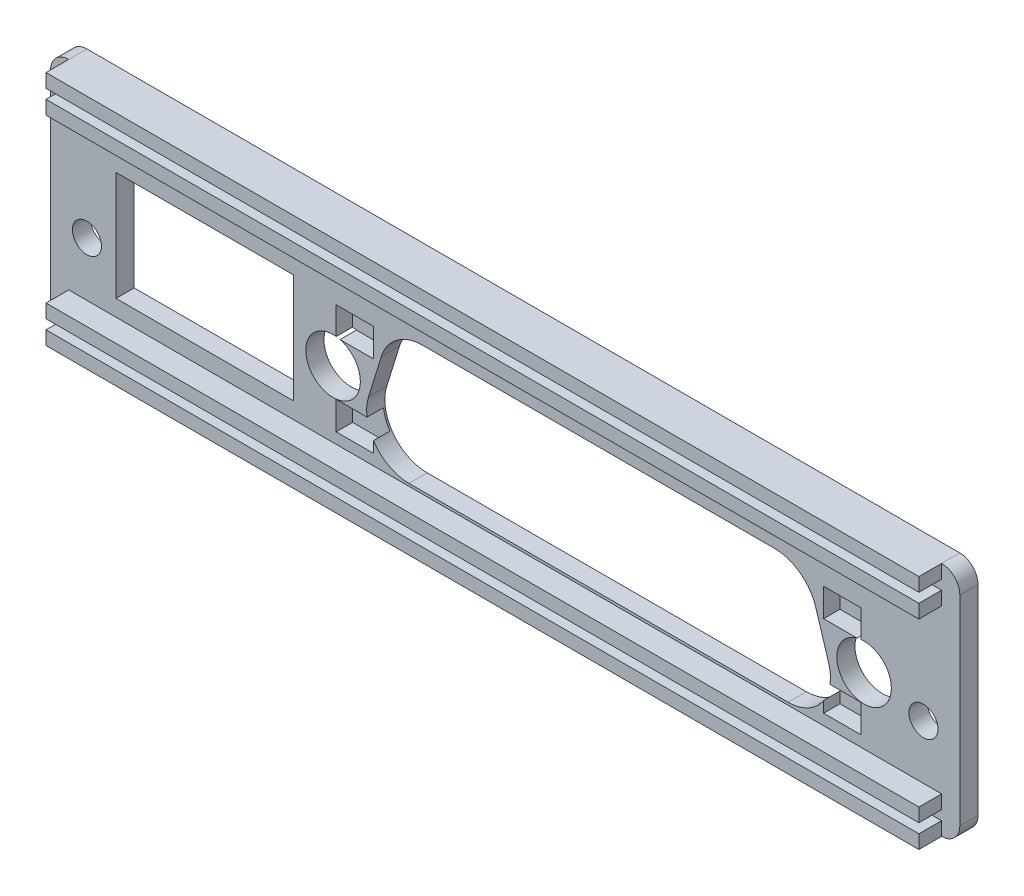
ISO-10303-21;
HEADER;
FILE_DESCRIPTION(('STEP AP214'),'2;1');
FILE_NAME('part.step','',(''),(''),'','','');
FILE_SCHEMA(('AUTOMOTIVE_DESIGN { 1 0 10303 214 1 1 1 1 }'));
ENDSEC;
DATA;
#1=APPLICATION_CONTEXT('core data for automotive mechanical design processes');
#2=APPLICATION_PROTOCOL_DEFINITION('international standard','automotive_design',2000,#1);
#3=PRODUCT_CONTEXT('',#1,'mechanical');
#4=PRODUCT('Part','Part','',(#3));
#5=PRODUCT_RELATED_PRODUCT_CATEGORY('part','',(#4));
#6=PRODUCT_DEFINITION_FORMATION('','',#4);
#7=PRODUCT_DEFINITION_CONTEXT('part definition',#1,'design');
#8=PRODUCT_DEFINITION('design','',#6,#7);
#9=PRODUCT_DEFINITION_SHAPE('','',#8);
#10=(LENGTH_UNIT() NAMED_UNIT(*) SI_UNIT(.MILLI.,.METRE.));
#11=(NAMED_UNIT(*) PLANE_ANGLE_UNIT() SI_UNIT($,.RADIAN.));
#12=(NAMED_UNIT(*) SI_UNIT($,.STERADIAN.) SOLID_ANGLE_UNIT());
#13=UNCERTAINTY_MEASURE_WITH_UNIT(LENGTH_MEASURE(1.E-05),#10,'distance_accuracy_value','');
#14=(GEOMETRIC_REPRESENTATION_CONTEXT(3) GLOBAL_UNCERTAINTY_ASSIGNED_CONTEXT((#13)) GLOBAL_UNIT_ASSIGNED_CONTEXT((#10,
#11,#12)) REPRESENTATION_CONTEXT('',''));
#15=CARTESIAN_POINT('',(0.,0.,0.));
#16=DIRECTION('',(0.,0.,1.));
#17=DIRECTION('',(1.,0.,0.));
#18=AXIS2_PLACEMENT_3D('',#15,#16,#17);
#19=CARTESIAN_POINT('',(-53.2499999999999,-11.5,2.));
#20=DIRECTION('',(0.,-1.,0.));
#21=DIRECTION('',(0.,0.,-1.));
#22=AXIS2_PLACEMENT_3D('',#19,#20,#21);
#23=PLANE('',#22);
#24=DIRECTION('',(-1.,0.,0.));
#25=VECTOR('',#24,1.);
#26=CARTESIAN_POINT('',(-48.25,-11.5,4.5));
#27=LINE('',#26,#25);
#28=CARTESIAN_POINT('',(48.,-11.5,4.5));
#29=VERTEX_POINT('',#28);
#30=CARTESIAN_POINT('',(-48.,-11.5,4.5));
#31=VERTEX_POINT('',#30);
#32=EDGE_CURVE('E383',#29,#31,#27,.T.);
#33=ORIENTED_EDGE('',*,*,#32,.T.);
#34=DIRECTION('',(0.,0.,-1.));
#35=VECTOR('',#34,1.);
#36=CARTESIAN_POINT('',(-48.,-11.5,7.));
#37=LINE('',#36,#35);
#38=CARTESIAN_POINT('',(-48.,-11.5,7.));
#39=VERTEX_POINT('',#38);
#40=EDGE_CURVE('E393',#39,#31,#37,.T.);
#41=ORIENTED_EDGE('',*,*,#40,.F.);
#42=DIRECTION('',(1.,0.,0.));
#43=VECTOR('',#42,1.);
#44=CARTESIAN_POINT('',(-48.,-11.5,7.));
#45=LINE('',#44,#43);
#46=CARTESIAN_POINT('',(48.,-11.5,7.));
#47=VERTEX_POINT('',#46);
#48=EDGE_CURVE('E518',#39,#47,#45,.T.);
#49=ORIENTED_EDGE('',*,*,#48,.T.);
#50=DIRECTION('',(0.,0.,-1.));
#51=VECTOR('',#50,1.);
#52=CARTESIAN_POINT('',(48.,-11.5,7.));
#53=LINE('',#52,#51);
#54=EDGE_CURVE('E400',#47,#29,#53,.T.);
#55=ORIENTED_EDGE('',*,*,#54,.T.);
#56=EDGE_LOOP('',(#33,#41,#49,#55));
#57=FACE_BOUND('',#56,.T.);
#58=ADVANCED_FACE('F37',(#57),#23,.F.);
#59=CARTESIAN_POINT('',(-53.2499999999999,-10.45,2.));
#60=DIRECTION('',(0.,1.,0.));
#61=DIRECTION('',(0.,0.,1.));
#62=AXIS2_PLACEMENT_3D('',#59,#60,#61);
#63=PLANE('',#62);
#64=DIRECTION('',(-1.,0.,0.));
#65=VECTOR('',#64,1.);
#66=CARTESIAN_POINT('',(-48.25,-10.45,4.5));
#67=LINE('',#66,#65);
#68=CARTESIAN_POINT('',(48.,-10.45,4.5));
#69=VERTEX_POINT('',#68);
#70=CARTESIAN_POINT('',(-48.,-10.45,4.5));
#71=VERTEX_POINT('',#70);
#72=EDGE_CURVE('E405',#69,#71,#67,.T.);
#73=ORIENTED_EDGE('',*,*,#72,.F.);
#74=DIRECTION('',(0.,0.,-1.));
#75=VECTOR('',#74,1.);
#76=CARTESIAN_POINT('',(48.,-10.45,7.));
#77=LINE('',#76,#75);
#78=CARTESIAN_POINT('',(48.,-10.45,7.));
#79=VERTEX_POINT('',#78);
#80=EDGE_CURVE('E510',#79,#69,#77,.T.);
#81=ORIENTED_EDGE('',*,*,#80,.F.);
#82=DIRECTION('',(-1.,0.,0.));
#83=VECTOR('',#82,1.);
#84=CARTESIAN_POINT('',(-48.,-10.45,7.));
#85=LINE('',#84,#83);
#86=CARTESIAN_POINT('',(-48.,-10.45,7.));
#87=VERTEX_POINT('',#86);
#88=EDGE_CURVE('E489',#79,#87,#85,.T.);
#89=ORIENTED_EDGE('',*,*,#88,.T.);
#90=DIRECTION('',(0.,0.,-1.));
#91=VECTOR('',#90,1.);
#92=CARTESIAN_POINT('',(-48.,-10.45,7.));
#93=LINE('',#92,#91);
#94=EDGE_CURVE('E513',#87,#71,#93,.T.);
#95=ORIENTED_EDGE('',*,*,#94,.T.);
#96=EDGE_LOOP('',(#73,#81,#89,#95));
#97=FACE_BOUND('',#96,.T.);
#98=ADVANCED_FACE('F772',(#97),#63,.F.);
#99=CARTESIAN_POINT('',(-53.2500000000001,10.45,2.));
#100=DIRECTION('',(0.,-1.,0.));
#101=DIRECTION('',(0.,0.,-1.));
#102=AXIS2_PLACEMENT_3D('',#99,#100,#101);
#103=PLANE('',#102);
#104=DIRECTION('',(1.,0.,0.));
#105=VECTOR('',#104,1.);
#106=CARTESIAN_POINT('',(-48.25,10.45,4.5));
#107=LINE('',#106,#105);
#108=CARTESIAN_POINT('',(-48.,10.45,4.5));
#109=VERTEX_POINT('',#108);
#110=CARTESIAN_POINT('',(48.,10.45,4.5));
#111=VERTEX_POINT('',#110);
#112=EDGE_CURVE('E404',#109,#111,#107,.T.);
#113=ORIENTED_EDGE('',*,*,#112,.F.);
#114=DIRECTION('',(0.,0.,-1.));
#115=VECTOR('',#114,1.);
#116=CARTESIAN_POINT('',(-48.,10.45,7.));
#117=LINE('',#116,#115);
#118=CARTESIAN_POINT('',(-48.,10.45,7.));
#119=VERTEX_POINT('',#118);
#120=EDGE_CURVE('E541',#119,#109,#117,.T.);
#121=ORIENTED_EDGE('',*,*,#120,.F.);
#122=DIRECTION('',(-1.,0.,0.));
#123=VECTOR('',#122,1.);
#124=CARTESIAN_POINT('',(-48.,10.45,7.));
#125=LINE('',#124,#123);
#126=CARTESIAN_POINT('',(48.,10.45,7.));
#127=VERTEX_POINT('',#126);
#128=EDGE_CURVE('E539',#127,#119,#125,.T.);
#129=ORIENTED_EDGE('',*,*,#128,.F.);
#130=DIRECTION('',(0.,0.,-1.));
#131=VECTOR('',#130,1.);
#132=CARTESIAN_POINT('',(48.,10.45,7.));
#133=LINE('',#132,#131);
#134=EDGE_CURVE('E550',#127,#111,#133,.T.);
#135=ORIENTED_EDGE('',*,*,#134,.T.);
#136=EDGE_LOOP('',(#113,#121,#129,#135));
#137=FACE_BOUND('',#136,.T.);
#138=ADVANCED_FACE('F777',(#137),#103,.F.);
#139=CARTESIAN_POINT('',(-53.2500000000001,11.5,2.));
#140=DIRECTION('',(0.,1.,0.));
#141=DIRECTION('',(0.,0.,1.));
#142=AXIS2_PLACEMENT_3D('',#139,#140,#141);
#143=PLANE('',#142);
#144=DIRECTION('',(1.,0.,0.));
#145=VECTOR('',#144,1.);
#146=CARTESIAN_POINT('',(-48.25,11.5,4.5));
#147=LINE('',#146,#145);
#148=CARTESIAN_POINT('',(-48.,11.5,4.5));
#149=VERTEX_POINT('',#148);
#150=CARTESIAN_POINT('',(48.,11.5,4.5));
#151=VERTEX_POINT('',#150);
#152=EDGE_CURVE('E408',#149,#151,#147,.T.);
#153=ORIENTED_EDGE('',*,*,#152,.T.);
#154=DIRECTION('',(0.,0.,-1.));
#155=VECTOR('',#154,1.);
#156=CARTESIAN_POINT('',(48.,11.5,7.));
#157=LINE('',#156,#155);
#158=CARTESIAN_POINT('',(48.,11.5,7.));
#159=VERTEX_POINT('',#158);
#160=EDGE_CURVE('E568',#159,#151,#157,.T.);
#161=ORIENTED_EDGE('',*,*,#160,.F.);
#162=DIRECTION('',(1.,0.,0.));
#163=VECTOR('',#162,1.);
#164=CARTESIAN_POINT('',(-48.,11.5,7.));
#165=LINE('',#164,#163);
#166=CARTESIAN_POINT('',(-48.,11.5,7.));
#167=VERTEX_POINT('',#166);
#168=EDGE_CURVE('E566',#167,#159,#165,.T.);
#169=ORIENTED_EDGE('',*,*,#168,.F.);
#170=DIRECTION('',(0.,0.,-1.));
#171=VECTOR('',#170,1.);
#172=CARTESIAN_POINT('',(-48.,11.5,7.));
#173=LINE('',#172,#171);
#174=EDGE_CURVE('E574',#167,#149,#173,.T.);
#175=ORIENTED_EDGE('',*,*,#174,.T.);
#176=EDGE_LOOP('',(#153,#161,#169,#175));
#177=FACE_BOUND('',#176,.T.);
#178=ADVANCED_FACE('F786',(#177),#143,.F.);
#179=CARTESIAN_POINT('',(0.,13.,0.));
#180=DIRECTION('',(0.,1.,0.));
#181=DIRECTION('',(0.,0.,1.));
#182=AXIS2_PLACEMENT_3D('',#179,#180,#181);
#183=PLANE('',#182);
#184=DIRECTION('',(0.,0.,-1.));
#185=VECTOR('',#184,1.);
#186=CARTESIAN_POINT('',(48.,13.,0.));
#187=LINE('',#186,#185);
#188=CARTESIAN_POINT('',(48.,13.,4.5));
#189=VERTEX_POINT('',#188);
#190=CARTESIAN_POINT('',(48.,13.,2.5));
#191=VERTEX_POINT('',#190);
#192=EDGE_CURVE('E1048',#189,#191,#187,.T.);
#193=ORIENTED_EDGE('',*,*,#192,.T.);
#194=DIRECTION('',(1.,0.,0.));
#195=VECTOR('',#194,1.);
#196=CARTESIAN_POINT('',(-48.,13.,2.5));
#197=LINE('',#196,#195);
#198=CARTESIAN_POINT('',(-48.,13.,2.5));
#199=VERTEX_POINT('',#198);
#200=EDGE_CURVE('E429',#199,#191,#197,.T.);
#201=ORIENTED_EDGE('',*,*,#200,.F.);
#202=DIRECTION('',(0.,0.,-1.));
#203=VECTOR('',#202,1.);
#204=CARTESIAN_POINT('',(-48.,13.,4.5));
#205=LINE('',#204,#203);
#206=CARTESIAN_POINT('',(-48.,13.,4.5));
#207=VERTEX_POINT('',#206);
#208=EDGE_CURVE('E1046',#199,#207,#205,.F.);
#209=ORIENTED_EDGE('',*,*,#208,.T.);
#210=DIRECTION('',(0.,0.,-1.));
#211=VECTOR('',#210,1.);
#212=CARTESIAN_POINT('',(-48.,13.,7.));
#213=LINE('',#212,#211);
#214=CARTESIAN_POINT('',(-48.,13.,7.));
#215=VERTEX_POINT('',#214);
#216=EDGE_CURVE('E577',#215,#207,#213,.T.);
#217=ORIENTED_EDGE('',*,*,#216,.F.);
#218=DIRECTION('',(-1.,0.,0.));
#219=VECTOR('',#218,1.);
#220=CARTESIAN_POINT('',(-48.,13.,7.));
#221=LINE('',#220,#219);
#222=CARTESIAN_POINT('',(48.,13.,7.));
#223=VERTEX_POINT('',#222);
#224=EDGE_CURVE('E561',#223,#215,#221,.T.);
#225=ORIENTED_EDGE('',*,*,#224,.F.);
#226=DIRECTION('',(0.,0.,-1.));
#227=VECTOR('',#226,1.);
#228=CARTESIAN_POINT('',(48.,13.,7.));
#229=LINE('',#228,#227);
#230=EDGE_CURVE('E580',#223,#189,#229,.T.);
#231=ORIENTED_EDGE('',*,*,#230,.T.);
#232=EDGE_LOOP('',(#193,#201,#209,#217,#225,#231));
#233=FACE_BOUND('',#232,.T.);
#234=ADVANCED_FACE('F790',(#233),#183,.T.);
#235=CARTESIAN_POINT('',(0.,-13.,0.));
#236=DIRECTION('',(0.,-1.,0.));
#237=DIRECTION('',(0.,0.,-1.));
#238=AXIS2_PLACEMENT_3D('',#235,#236,#237);
#239=PLANE('',#238);
#240=DIRECTION('',(0.,0.,1.));
#241=VECTOR('',#240,1.);
#242=CARTESIAN_POINT('',(-48.,-13.,0.));
#243=LINE('',#242,#241);
#244=CARTESIAN_POINT('',(-48.,-13.,4.5));
#245=VERTEX_POINT('',#244);
#246=CARTESIAN_POINT('',(-48.,-13.,2.5));
#247=VERTEX_POINT('',#246);
#248=EDGE_CURVE('E1029',#245,#247,#243,.F.);
#249=ORIENTED_EDGE('',*,*,#248,.T.);
#250=DIRECTION('',(-1.,0.,0.));
#251=VECTOR('',#250,1.);
#252=CARTESIAN_POINT('',(48.,-13.,2.5));
#253=LINE('',#252,#251);
#254=CARTESIAN_POINT('',(48.,-13.,2.5));
#255=VERTEX_POINT('',#254);
#256=EDGE_CURVE('E421',#255,#247,#253,.T.);
#257=ORIENTED_EDGE('',*,*,#256,.F.);
#258=DIRECTION('',(0.,0.,1.));
#259=VECTOR('',#258,1.);
#260=CARTESIAN_POINT('',(48.,-13.,4.5));
#261=LINE('',#260,#259);
#262=CARTESIAN_POINT('',(48.,-13.,4.5));
#263=VERTEX_POINT('',#262);
#264=EDGE_CURVE('E1032',#255,#263,#261,.T.);
#265=ORIENTED_EDGE('',*,*,#264,.T.);
#266=DIRECTION('',(0.,0.,-1.));
#267=VECTOR('',#266,1.);
#268=CARTESIAN_POINT('',(48.,-13.,7.));
#269=LINE('',#268,#267);
#270=CARTESIAN_POINT('',(48.,-13.,7.));
#271=VERTEX_POINT('',#270);
#272=EDGE_CURVE('E524',#271,#263,#269,.T.);
#273=ORIENTED_EDGE('',*,*,#272,.F.);
#274=DIRECTION('',(-1.,0.,0.));
#275=VECTOR('',#274,1.);
#276=CARTESIAN_POINT('',(-48.,-13.,7.));
#277=LINE('',#276,#275);
#278=CARTESIAN_POINT('',(-48.,-13.,7.));
#279=VERTEX_POINT('',#278);
#280=EDGE_CURVE('E521',#271,#279,#277,.T.);
#281=ORIENTED_EDGE('',*,*,#280,.T.);
#282=DIRECTION('',(0.,0.,-1.));
#283=VECTOR('',#282,1.);
#284=CARTESIAN_POINT('',(-48.,-13.,7.));
#285=LINE('',#284,#283);
#286=EDGE_CURVE('E401',#279,#245,#285,.T.);
#287=ORIENTED_EDGE('',*,*,#286,.T.);
#288=EDGE_LOOP('',(#249,#257,#265,#273,#281,#287));
#289=FACE_BOUND('',#288,.T.);
#290=ADVANCED_FACE('F747',(#289),#239,.T.);
#291=CARTESIAN_POINT('',(31.1190086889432,-8.65999251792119,0.));
#292=CARTESIAN_POINT('',(31.4458386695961,-8.65999246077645,0.));
#293=CARTESIAN_POINT('',(32.0807435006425,-8.59640142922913,0.));
#294=CARTESIAN_POINT('',(33.4568785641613,-8.15096991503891,0.));
#295=CARTESIAN_POINT('',(35.0295312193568,-6.89165814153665,0.));
#296=CARTESIAN_POINT('',(35.7665956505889,-5.01660119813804,0.));
#297=CARTESIAN_POINT('',(35.784491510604,-3.57028287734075,0.));
#298=CARTESIAN_POINT('',(35.6571977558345,-2.94502751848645,0.));
#299=CARTESIAN_POINT('',(35.5604045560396,-2.63285943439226,0.));
#300=B_SPLINE_CURVE_WITH_KNOTS('',3,(#291,#292,#293,#294,#295,#296,#297,#298,#299),
.UNSPECIFIED.,.F.,.F.,(4,1,1,1,1,1,4),(0.,0.125,0.25,0.5,0.75,0.875,1.),.UNSPECIFIED.);
#301=DIRECTION('',(0.,0.,1.));
#302=VECTOR('',#301,1.);
#303=SURFACE_OF_LINEAR_EXTRUSION('',#300,#302);
#304=CARTESIAN_POINT('',(31.1190086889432,-8.65999251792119,2.5));
#305=CARTESIAN_POINT('',(31.4458386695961,-8.65999246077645,2.5));
#306=CARTESIAN_POINT('',(32.0807435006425,-8.59640142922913,2.5));
#307=CARTESIAN_POINT('',(33.4568785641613,-8.15096991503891,2.5));
#308=CARTESIAN_POINT('',(35.0295312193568,-6.89165814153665,2.5));
#309=CARTESIAN_POINT('',(35.7665956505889,-5.01660119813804,2.5));
#310=CARTESIAN_POINT('',(35.784491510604,-3.57028287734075,2.5));
#311=CARTESIAN_POINT('',(35.6571977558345,-2.94502751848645,2.5));
#312=CARTESIAN_POINT('',(35.5604045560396,-2.63285943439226,2.5));
#313=B_SPLINE_CURVE_WITH_KNOTS('',3,(#304,#305,#306,#307,#308,#309,#310,#311,#312),
.UNSPECIFIED.,.F.,.F.,(4,1,1,1,1,1,4),(0.,0.125,0.25,0.5,0.75,0.875,1.),.UNSPECIFIED.);
#314=CARTESIAN_POINT('',(31.1190086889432,-8.65999251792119,2.5));
#315=VERTEX_POINT('',#314);
#316=CARTESIAN_POINT('',(35.5604045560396,-2.63285943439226,2.5));
#317=VERTEX_POINT('',#316);
#318=EDGE_CURVE('E52',#315,#317,#313,.T.);
#319=ORIENTED_EDGE('',*,*,#318,.F.);
#320=DIRECTION('',(0.,0.,1.));
#321=VECTOR('',#320,1.);
#322=CARTESIAN_POINT('',(31.1190086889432,-8.65999251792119,0.));
#323=LINE('',#322,#321);
#324=CARTESIAN_POINT('',(31.1190086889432,-8.65999251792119,4.5));
#325=VERTEX_POINT('',#324);
#326=EDGE_CURVE('E968',#315,#325,#323,.T.);
#327=ORIENTED_EDGE('',*,*,#326,.T.);
#328=CARTESIAN_POINT('',(31.1190086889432,-8.65999251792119,4.5));
#329=CARTESIAN_POINT('',(31.4458386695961,-8.65999246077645,4.5));
#330=CARTESIAN_POINT('',(32.0807435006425,-8.59640142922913,4.5));
#331=CARTESIAN_POINT('',(33.4568785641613,-8.15096991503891,4.5));
#332=CARTESIAN_POINT('',(35.0295312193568,-6.89165814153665,4.5));
#333=CARTESIAN_POINT('',(35.7665956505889,-5.01660119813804,4.5));
#334=CARTESIAN_POINT('',(35.784491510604,-3.57028287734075,4.5));
#335=CARTESIAN_POINT('',(35.6571977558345,-2.94502751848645,4.5));
#336=CARTESIAN_POINT('',(35.5604045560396,-2.63285943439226,4.5));
#337=B_SPLINE_CURVE_WITH_KNOTS('',3,(#328,#329,#330,#331,#332,#333,#334,#335,#336),
.UNSPECIFIED.,.F.,.F.,(4,1,1,1,1,1,4),(0.,0.125,0.25,0.5,0.75,0.875,1.),.UNSPECIFIED.);
#338=CARTESIAN_POINT('',(35.0190081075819,-6.54155022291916,4.5));
#339=VERTEX_POINT('',#338);
#340=EDGE_CURVE('E919',#325,#339,#337,.T.);
#341=ORIENTED_EDGE('',*,*,#340,.T.);
#342=DIRECTION('',(0.,0.,1.));
#343=VECTOR('',#342,1.);
#344=CARTESIAN_POINT('',(35.0190081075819,-6.54155022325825,0.));
#345=LINE('',#344,#343);
#346=CARTESIAN_POINT('',(35.0190081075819,-6.54155022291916,2.7));
#347=VERTEX_POINT('',#346);
#348=EDGE_CURVE('E1026',#339,#347,#345,.F.);
#349=ORIENTED_EDGE('',*,*,#348,.T.);
#350=CARTESIAN_POINT('',(31.1190086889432,-8.65999251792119,2.7));
#351=CARTESIAN_POINT('',(31.4458386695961,-8.65999246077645,2.7));
#352=CARTESIAN_POINT('',(32.0807435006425,-8.59640142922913,2.7));
#353=CARTESIAN_POINT('',(33.4568785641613,-8.15096991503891,2.7));
#354=CARTESIAN_POINT('',(35.0295312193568,-6.89165814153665,2.7));
#355=CARTESIAN_POINT('',(35.7665956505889,-5.01660119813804,2.7));
#356=CARTESIAN_POINT('',(35.784491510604,-3.57028287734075,2.7));
#357=CARTESIAN_POINT('',(35.6571977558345,-2.94502751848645,2.7));
#358=CARTESIAN_POINT('',(35.5604045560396,-2.63285943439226,2.7));
#359=B_SPLINE_CURVE_WITH_KNOTS('',3,(#350,#351,#352,#353,#354,#355,#356,#357,#358),
.UNSPECIFIED.,.F.,.F.,(4,1,1,1,1,1,4),(0.,0.125,0.25,0.5,0.75,0.875,1.),.UNSPECIFIED.);
#360=CARTESIAN_POINT('',(35.7233531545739,-4.65999140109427,2.7));
#361=VERTEX_POINT('',#360);
#362=EDGE_CURVE('E1015',#347,#361,#359,.T.);
#363=ORIENTED_EDGE('',*,*,#362,.T.);
#364=DIRECTION('',(0.,0.,1.));
#365=VECTOR('',#364,1.);
#366=CARTESIAN_POINT('',(35.7233531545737,-4.65999140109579,0.));
#367=LINE('',#366,#365);
#368=CARTESIAN_POINT('',(35.7233531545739,-4.6599914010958,4.5));
#369=VERTEX_POINT('',#368);
#370=EDGE_CURVE('E1020',#361,#369,#367,.T.);
#371=ORIENTED_EDGE('',*,*,#370,.T.);
#372=CARTESIAN_POINT('',(35.5604045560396,-2.63285943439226,4.5));
#373=VERTEX_POINT('',#372);
#374=EDGE_CURVE('E722',#369,#373,#337,.T.);
#375=ORIENTED_EDGE('',*,*,#374,.T.);
#376=DIRECTION('',(0.,0.,1.));
#377=VECTOR('',#376,1.);
#378=CARTESIAN_POINT('',(35.5604045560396,-2.63285943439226,0.));
#379=LINE('',#378,#377);
#380=EDGE_CURVE('E967',#317,#373,#379,.T.);
#381=ORIENTED_EDGE('',*,*,#380,.F.);
#382=EDGE_LOOP('',(#319,#327,#341,#349,#363,#371,#375,#381));
#383=FACE_BOUND('',#382,.T.);
#384=ADVANCED_FACE('F742',(#383),#303,.F.);
#385=CARTESIAN_POINT('',(-10.580991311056,-8.65999980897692,0.));
#386=DIRECTION('',(1.74845461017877E-07,-0.999999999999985,0.));
#387=DIRECTION('',(0.999999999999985,1.74845461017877E-07,0.));
#388=AXIS2_PLACEMENT_3D('',#385,#386,#387);
#389=PLANE('',#388);
#390=DIRECTION('',(0.999999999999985,1.74845461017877E-07,0.));
#391=VECTOR('',#390,1.);
#392=CARTESIAN_POINT('',(-10.580991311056,-8.65999980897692,2.5));
#393=LINE('',#392,#391);
#394=CARTESIAN_POINT('',(-10.580991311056,-8.65999980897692,2.5));
#395=VERTEX_POINT('',#394);
#396=EDGE_CURVE('E474',#395,#315,#393,.T.);
#397=ORIENTED_EDGE('',*,*,#396,.F.);
#398=DIRECTION('',(0.,0.,1.));
#399=VECTOR('',#398,1.);
#400=CARTESIAN_POINT('',(-10.580991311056,-8.65999980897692,0.));
#401=LINE('',#400,#399);
#402=CARTESIAN_POINT('',(-10.580991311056,-8.65999980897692,4.5));
#403=VERTEX_POINT('',#402);
#404=EDGE_CURVE('E971',#395,#403,#401,.T.);
#405=ORIENTED_EDGE('',*,*,#404,.T.);
#406=DIRECTION('',(0.999999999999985,1.74845461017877E-07,0.));
#407=VECTOR('',#406,1.);
#408=CARTESIAN_POINT('',(-10.580991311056,-8.65999980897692,4.5));
#409=LINE('',#408,#407);
#410=EDGE_CURVE('E961',#403,#325,#409,.T.);
#411=ORIENTED_EDGE('',*,*,#410,.T.);
#412=ORIENTED_EDGE('',*,*,#326,.F.);
#413=EDGE_LOOP('',(#397,#405,#411,#412));
#414=FACE_BOUND('',#413,.T.);
#415=ADVANCED_FACE('F746',(#414),#389,.F.);
#416=CARTESIAN_POINT('',(-15.0223892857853,-2.63286827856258,0.));
#417=CARTESIAN_POINT('',(-15.1191823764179,-2.94503639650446,0.));
#418=CARTESIAN_POINT('',(-15.2464759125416,-3.57029179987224,0.));
#419=CARTESIAN_POINT('',(-15.2285795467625,-5.0166101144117,0.));
#420=CARTESIAN_POINT('',(-14.4915144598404,-6.89166680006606,0.));
#421=CARTESIAN_POINT('',(-12.9188613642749,-8.15097802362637,0.));
#422=CARTESIAN_POINT('',(-11.5427261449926,-8.59640905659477,0.));
#423=CARTESIAN_POINT('',(-10.9078212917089,-8.65999986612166,0.));
#424=CARTESIAN_POINT('',(-10.580991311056,-8.65999980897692,0.));
#425=B_SPLINE_CURVE_WITH_KNOTS('',3,(#416,#417,#418,#419,#420,#421,#422,#423,#424),
.UNSPECIFIED.,.F.,.F.,(4,1,1,1,1,1,4),(0.,0.125,0.25,0.5,0.75,0.875,1.),.UNSPECIFIED.);
#426=DIRECTION('',(0.,0.,1.));
#427=VECTOR('',#426,1.);
#428=SURFACE_OF_LINEAR_EXTRUSION('',#425,#427);
#429=CARTESIAN_POINT('',(-15.0223892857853,-2.63286827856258,2.5));
#430=CARTESIAN_POINT('',(-15.1191823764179,-2.94503639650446,2.5));
#431=CARTESIAN_POINT('',(-15.2464759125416,-3.57029179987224,2.5));
#432=CARTESIAN_POINT('',(-15.2285795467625,-5.0166101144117,2.5));
#433=CARTESIAN_POINT('',(-14.4915144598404,-6.89166680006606,2.5));
#434=CARTESIAN_POINT('',(-12.9188613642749,-8.15097802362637,2.5));
#435=CARTESIAN_POINT('',(-11.5427261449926,-8.59640905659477,2.5));
#436=CARTESIAN_POINT('',(-10.9078212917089,-8.65999986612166,2.5));
#437=CARTESIAN_POINT('',(-10.580991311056,-8.65999980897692,2.5));
#438=B_SPLINE_CURVE_WITH_KNOTS('',3,(#429,#430,#431,#432,#433,#434,#435,#436,#437),
.UNSPECIFIED.,.F.,.F.,(4,1,1,1,1,1,4),(0.,0.125,0.25,0.5,0.75,0.875,1.),.UNSPECIFIED.);
#439=CARTESIAN_POINT('',(-15.0223892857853,-2.63286827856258,2.5));
#440=VERTEX_POINT('',#439);
#441=EDGE_CURVE('E470',#440,#395,#438,.T.);
#442=ORIENTED_EDGE('',*,*,#441,.F.);
#443=DIRECTION('',(0.,0.,1.));
#444=VECTOR('',#443,1.);
#445=CARTESIAN_POINT('',(-15.0223892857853,-2.63286827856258,0.));
#446=LINE('',#445,#444);
#447=CARTESIAN_POINT('',(-15.0223892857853,-2.63286827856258,4.5));
#448=VERTEX_POINT('',#447);
#449=EDGE_CURVE('E973',#440,#448,#446,.T.);
#450=ORIENTED_EDGE('',*,*,#449,.T.);
#451=CARTESIAN_POINT('',(-15.0223892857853,-2.63286827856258,4.5));
#452=CARTESIAN_POINT('',(-15.1191823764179,-2.94503639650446,4.5));
#453=CARTESIAN_POINT('',(-15.2464759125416,-3.57029179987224,4.5));
#454=CARTESIAN_POINT('',(-15.2285795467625,-5.0166101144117,4.5));
#455=CARTESIAN_POINT('',(-14.4915144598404,-6.89166680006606,4.5));
#456=CARTESIAN_POINT('',(-12.9188613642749,-8.15097802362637,4.5));
#457=CARTESIAN_POINT('',(-11.5427261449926,-8.59640905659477,4.5));
#458=CARTESIAN_POINT('',(-10.9078212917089,-8.65999986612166,4.5));
#459=CARTESIAN_POINT('',(-10.580991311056,-8.65999980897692,4.5));
#460=B_SPLINE_CURVE_WITH_KNOTS('',3,(#451,#452,#453,#454,#455,#456,#457,#458,#459),
.UNSPECIFIED.,.F.,.F.,(4,1,1,1,1,1,4),(0.,0.125,0.25,0.5,0.75,0.875,1.),.UNSPECIFIED.);
#461=CARTESIAN_POINT('',(-15.1853371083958,-4.6600007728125,4.5));
#462=VERTEX_POINT('',#461);
#463=EDGE_CURVE('E956',#448,#462,#460,.T.);
#464=ORIENTED_EDGE('',*,*,#463,.T.);
#465=DIRECTION('',(0.,0.,1.));
#466=VECTOR('',#465,1.);
#467=CARTESIAN_POINT('',(-15.1853371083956,-4.6600007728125,0.));
#468=LINE('',#467,#466);
#469=CARTESIAN_POINT('',(-15.1853371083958,-4.6600007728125,2.7));
#470=VERTEX_POINT('',#469);
#471=EDGE_CURVE('E1006',#462,#470,#468,.F.);
#472=ORIENTED_EDGE('',*,*,#471,.T.);
#473=CARTESIAN_POINT('',(-15.0223892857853,-2.63286827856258,2.7));
#474=CARTESIAN_POINT('',(-15.1191823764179,-2.94503639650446,2.7));
#475=CARTESIAN_POINT('',(-15.2464759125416,-3.57029179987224,2.7));
#476=CARTESIAN_POINT('',(-15.2285795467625,-5.0166101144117,2.7));
#477=CARTESIAN_POINT('',(-14.4915144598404,-6.89166680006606,2.7));
#478=CARTESIAN_POINT('',(-12.9188613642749,-8.15097802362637,2.7));
#479=CARTESIAN_POINT('',(-11.5427261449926,-8.59640905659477,2.7));
#480=CARTESIAN_POINT('',(-10.9078212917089,-8.65999986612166,2.7));
#481=CARTESIAN_POINT('',(-10.580991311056,-8.65999980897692,2.7));
#482=B_SPLINE_CURVE_WITH_KNOTS('',3,(#473,#474,#475,#476,#477,#478,#479,#480,#481),
.UNSPECIFIED.,.F.,.F.,(4,1,1,1,1,1,4),(0.,0.125,0.25,0.5,0.75,0.875,1.),.UNSPECIFIED.);
#483=CARTESIAN_POINT('',(-14.480991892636,-6.54155822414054,2.7));
#484=VERTEX_POINT('',#483);
#485=EDGE_CURVE('E1001',#470,#484,#482,.T.);
#486=ORIENTED_EDGE('',*,*,#485,.T.);
#487=DIRECTION('',(0.,0.,1.));
#488=VECTOR('',#487,1.);
#489=CARTESIAN_POINT('',(-14.4809918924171,-6.5415582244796,0.));
#490=LINE('',#489,#488);
#491=CARTESIAN_POINT('',(-14.4809918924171,-6.54155822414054,4.5));
#492=VERTEX_POINT('',#491);
#493=EDGE_CURVE('E1012',#484,#492,#490,.T.);
#494=ORIENTED_EDGE('',*,*,#493,.T.);
#495=EDGE_CURVE('E955',#492,#403,#460,.T.);
#496=ORIENTED_EDGE('',*,*,#495,.T.);
#497=ORIENTED_EDGE('',*,*,#404,.F.);
#498=EDGE_LOOP('',(#442,#450,#464,#472,#486,#494,#496,#497));
#499=FACE_BOUND('',#498,.T.);
#500=ADVANCED_FACE('F904',(#499),#428,.F.);
#501=CARTESIAN_POINT('',(-13.617903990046,1.89674771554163,0.));
#502=DIRECTION('',(-0.955139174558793,0.296157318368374,0.));
#503=DIRECTION('',(-0.296157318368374,-0.955139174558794,0.));
#504=AXIS2_PLACEMENT_3D('',#501,#502,#503);
#505=PLANE('',#504);
#506=DIRECTION('',(-0.296157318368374,-0.955139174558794,0.));
#507=VECTOR('',#506,1.);
#508=CARTESIAN_POINT('',(-13.617903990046,1.89674771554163,2.5));
#509=LINE('',#508,#507);
#510=CARTESIAN_POINT('',(-13.617903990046,1.89674771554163,2.5));
#511=VERTEX_POINT('',#510);
#512=EDGE_CURVE('E465',#511,#440,#509,.T.);
#513=ORIENTED_EDGE('',*,*,#512,.F.);
#514=DIRECTION('',(0.,0.,1.));
#515=VECTOR('',#514,1.);
#516=CARTESIAN_POINT('',(-13.617903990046,1.89674771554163,0.));
#517=LINE('',#516,#515);
#518=CARTESIAN_POINT('',(-13.617903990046,1.89674771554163,4.5));
#519=VERTEX_POINT('',#518);
#520=EDGE_CURVE('E975',#511,#519,#517,.T.);
#521=ORIENTED_EDGE('',*,*,#520,.T.);
#522=DIRECTION('',(-0.296157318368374,-0.955139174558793,0.));
#523=VECTOR('',#522,1.);
#524=CARTESIAN_POINT('',(-13.617903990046,1.89674771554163,4.5));
#525=LINE('',#524,#523);
#526=EDGE_CURVE('E949',#519,#448,#525,.T.);
#527=ORIENTED_EDGE('',*,*,#526,.T.);
#528=ORIENTED_EDGE('',*,*,#449,.F.);
#529=EDGE_LOOP('',(#513,#521,#527,#528));
#530=FACE_BOUND('',#529,.T.);
#531=ADVANCED_FACE('F909',(#530),#505,.F.);
#532=CARTESIAN_POINT('',(-9.08099374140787,5.24000045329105,0.));
#533=CARTESIAN_POINT('',(-9.56880474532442,5.24000036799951,0.));
#534=CARTESIAN_POINT('',(-10.5302743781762,5.0972962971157,0.));
#535=CARTESIAN_POINT('',(-11.9525853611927,4.3868512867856,0.));
#536=CARTESIAN_POINT('',(-13.0523868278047,3.23874964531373,0.));
#537=CARTESIAN_POINT('',(-13.4734351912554,2.36267511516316,0.));
#538=CARTESIAN_POINT('',(-13.617903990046,1.89674771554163,0.));
#539=B_SPLINE_CURVE_WITH_KNOTS('',3,(#532,#533,#534,#535,#536,#537,#538),.UNSPECIFIED.,.F.,.F.,
(4,1,1,1,4),(0.,0.25,0.5,0.75,1.),.UNSPECIFIED.);
#540=DIRECTION('',(0.,0.,1.));
#541=VECTOR('',#540,1.);
#542=SURFACE_OF_LINEAR_EXTRUSION('',#539,#541);
#543=CARTESIAN_POINT('',(-9.08099374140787,5.24000045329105,2.5));
#544=CARTESIAN_POINT('',(-9.56880474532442,5.24000036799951,2.5));
#545=CARTESIAN_POINT('',(-10.5302743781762,5.0972962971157,2.5));
#546=CARTESIAN_POINT('',(-11.9525853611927,4.3868512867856,2.5));
#547=CARTESIAN_POINT('',(-13.0523868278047,3.23874964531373,2.5));
#548=CARTESIAN_POINT('',(-13.4734351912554,2.36267511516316,2.5));
#549=CARTESIAN_POINT('',(-13.617903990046,1.89674771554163,2.5));
#550=B_SPLINE_CURVE_WITH_KNOTS('',3,(#543,#544,#545,#546,#547,#548,#549),.UNSPECIFIED.,.F.,.F.,
(4,1,1,1,4),(0.,0.25,0.5,0.75,1.),.UNSPECIFIED.);
#551=CARTESIAN_POINT('',(-9.08099374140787,5.24000045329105,2.5));
#552=VERTEX_POINT('',#551);
#553=EDGE_CURVE('E461',#552,#511,#550,.T.);
#554=ORIENTED_EDGE('',*,*,#553,.F.);
#555=DIRECTION('',(0.,0.,1.));
#556=VECTOR('',#555,1.);
#557=CARTESIAN_POINT('',(-9.08099374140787,5.24000045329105,0.));
#558=LINE('',#557,#556);
#559=CARTESIAN_POINT('',(-9.08099374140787,5.24000045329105,4.5));
#560=VERTEX_POINT('',#559);
#561=EDGE_CURVE('E977',#552,#560,#558,.T.);
#562=ORIENTED_EDGE('',*,*,#561,.T.);
#563=CARTESIAN_POINT('',(-9.08099374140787,5.24000045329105,4.5));
#564=CARTESIAN_POINT('',(-9.56880474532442,5.24000036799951,4.5));
#565=CARTESIAN_POINT('',(-10.5302743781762,5.0972962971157,4.5));
#566=CARTESIAN_POINT('',(-11.9525853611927,4.3868512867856,4.5));
#567=CARTESIAN_POINT('',(-13.0523868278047,3.23874964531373,4.5));
#568=CARTESIAN_POINT('',(-13.4734351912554,2.36267511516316,4.5));
#569=CARTESIAN_POINT('',(-13.617903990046,1.89674771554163,4.5));
#570=B_SPLINE_CURVE_WITH_KNOTS('',3,(#563,#564,#565,#566,#567,#568,#569),.UNSPECIFIED.,.F.,.F.,
(4,1,1,1,4),(0.,0.25,0.5,0.75,1.),.UNSPECIFIED.);
#571=EDGE_CURVE('E944',#560,#519,#570,.T.);
#572=ORIENTED_EDGE('',*,*,#571,.T.);
#573=ORIENTED_EDGE('',*,*,#520,.F.);
#574=EDGE_LOOP('',(#554,#562,#572,#573));
#575=FACE_BOUND('',#574,.T.);
#576=ADVANCED_FACE('F1189',(#575),#542,.F.);
#577=CARTESIAN_POINT('',(29.6190062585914,5.24000721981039,0.));
#578=DIRECTION('',(-1.74845461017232E-07,0.999999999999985,0.));
#579=DIRECTION('',(-0.999999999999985,-1.74845461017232E-07,0.));
#580=AXIS2_PLACEMENT_3D('',#577,#578,#579);
#581=PLANE('',#580);
#582=DIRECTION('',(-0.999999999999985,-1.74845461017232E-07,0.));
#583=VECTOR('',#582,1.);
#584=CARTESIAN_POINT('',(29.6190062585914,5.24000721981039,2.5));
#585=LINE('',#584,#583);
#586=CARTESIAN_POINT('',(29.6190062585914,5.24000721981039,2.5));
#587=VERTEX_POINT('',#586);
#588=EDGE_CURVE('E456',#587,#552,#585,.T.);
#589=ORIENTED_EDGE('',*,*,#588,.F.);
#590=DIRECTION('',(0.,0.,1.));
#591=VECTOR('',#590,1.);
#592=CARTESIAN_POINT('',(29.6190062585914,5.24000721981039,0.));
#593=LINE('',#592,#591);
#594=CARTESIAN_POINT('',(29.6190062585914,5.24000721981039,4.5));
#595=VERTEX_POINT('',#594);
#596=EDGE_CURVE('E979',#587,#595,#593,.T.);
#597=ORIENTED_EDGE('',*,*,#596,.T.);
#598=DIRECTION('',(-0.999999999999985,-1.74845461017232E-07,0.));
#599=VECTOR('',#598,1.);
#600=CARTESIAN_POINT('',(29.6190062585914,5.24000721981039,4.5));
#601=LINE('',#600,#599);
#602=EDGE_CURVE('E938',#595,#560,#601,.T.);
#603=ORIENTED_EDGE('',*,*,#602,.T.);
#604=ORIENTED_EDGE('',*,*,#561,.F.);
#605=EDGE_LOOP('',(#589,#597,#603,#604));
#606=FACE_BOUND('',#605,.T.);
#607=ADVANCED_FACE('F1182',(#606),#581,.F.);
#608=CARTESIAN_POINT('',(34.1559176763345,1.89675606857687,0.));
#609=CARTESIAN_POINT('',(34.0114487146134,2.36268341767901,0.));
#610=CARTESIAN_POINT('',(33.5904000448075,3.23875780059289,0.));
#611=CARTESIAN_POINT('',(32.4905981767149,4.38685905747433,0.));
#612=CARTESIAN_POINT('',(31.0682869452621,5.0973035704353,0.));
#613=CARTESIAN_POINT('',(30.106817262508,5.24000730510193,0.));
#614=CARTESIAN_POINT('',(29.6190062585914,5.24000721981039,0.));
#615=B_SPLINE_CURVE_WITH_KNOTS('',3,(#608,#609,#610,#611,#612,#613,#614),.UNSPECIFIED.,.F.,.F.,
(4,1,1,1,4),(0.,0.25,0.5,0.75,1.),.UNSPECIFIED.);
#616=DIRECTION('',(0.,0.,1.));
#617=VECTOR('',#616,1.);
#618=SURFACE_OF_LINEAR_EXTRUSION('',#615,#617);
#619=CARTESIAN_POINT('',(34.1559176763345,1.89675606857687,2.5));
#620=CARTESIAN_POINT('',(34.0114487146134,2.36268341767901,2.5));
#621=CARTESIAN_POINT('',(33.5904000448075,3.23875780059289,2.5));
#622=CARTESIAN_POINT('',(32.4905981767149,4.38685905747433,2.5));
#623=CARTESIAN_POINT('',(31.0682869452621,5.0973035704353,2.5));
#624=CARTESIAN_POINT('',(30.106817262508,5.24000730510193,2.5));
#625=CARTESIAN_POINT('',(29.6190062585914,5.24000721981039,2.5));
#626=B_SPLINE_CURVE_WITH_KNOTS('',3,(#619,#620,#621,#622,#623,#624,#625),.UNSPECIFIED.,.F.,.F.,
(4,1,1,1,4),(0.,0.25,0.5,0.75,1.),.UNSPECIFIED.);
#627=CARTESIAN_POINT('',(34.1559176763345,1.89675606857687,2.5));
#628=VERTEX_POINT('',#627);
#629=EDGE_CURVE('E452',#628,#587,#626,.T.);
#630=ORIENTED_EDGE('',*,*,#629,.F.);
#631=DIRECTION('',(0.,0.,1.));
#632=VECTOR('',#631,1.);
#633=CARTESIAN_POINT('',(34.1559176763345,1.89675606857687,0.));
#634=LINE('',#633,#632);
#635=CARTESIAN_POINT('',(34.1559176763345,1.89675606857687,4.5));
#636=VERTEX_POINT('',#635);
#637=EDGE_CURVE('E981',#628,#636,#634,.T.);
#638=ORIENTED_EDGE('',*,*,#637,.T.);
#639=CARTESIAN_POINT('',(34.1559176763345,1.89675606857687,4.5));
#640=CARTESIAN_POINT('',(34.0114487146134,2.36268341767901,4.5));
#641=CARTESIAN_POINT('',(33.5904000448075,3.23875780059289,4.5));
#642=CARTESIAN_POINT('',(32.4905981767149,4.38685905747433,4.5));
#643=CARTESIAN_POINT('',(31.0682869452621,5.0973035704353,4.5));
#644=CARTESIAN_POINT('',(30.106817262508,5.24000730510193,4.5));
#645=CARTESIAN_POINT('',(29.6190062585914,5.24000721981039,4.5));
#646=B_SPLINE_CURVE_WITH_KNOTS('',3,(#639,#640,#641,#642,#643,#644,#645),.UNSPECIFIED.,.F.,.F.,
(4,1,1,1,4),(0.,0.25,0.5,0.75,1.),.UNSPECIFIED.);
#647=EDGE_CURVE('E933',#636,#595,#646,.T.);
#648=ORIENTED_EDGE('',*,*,#647,.T.);
#649=ORIENTED_EDGE('',*,*,#596,.F.);
#650=EDGE_LOOP('',(#630,#638,#648,#649));
#651=FACE_BOUND('',#650,.T.);
#652=ADVANCED_FACE('F1175',(#651),#618,.F.);
#653=CARTESIAN_POINT('',(35.5604045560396,-2.63285943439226,0.));
#654=DIRECTION('',(0.955139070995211,0.296157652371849,0.));
#655=DIRECTION('',(-0.296157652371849,0.955139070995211,0.));
#656=AXIS2_PLACEMENT_3D('',#653,#654,#655);
#657=PLANE('',#656);
#658=DIRECTION('',(-0.296157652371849,0.955139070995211,0.));
#659=VECTOR('',#658,1.);
#660=CARTESIAN_POINT('',(35.5604045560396,-2.63285943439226,2.5));
#661=LINE('',#660,#659);
#662=EDGE_CURVE('E450',#317,#628,#661,.T.);
#663=ORIENTED_EDGE('',*,*,#662,.F.);
#664=ORIENTED_EDGE('',*,*,#380,.T.);
#665=DIRECTION('',(-0.296157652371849,0.955139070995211,0.));
#666=VECTOR('',#665,1.);
#667=CARTESIAN_POINT('',(35.5604045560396,-2.63285943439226,4.5));
#668=LINE('',#667,#666);
#669=EDGE_CURVE('E927',#373,#636,#668,.T.);
#670=ORIENTED_EDGE('',*,*,#669,.T.);
#671=ORIENTED_EDGE('',*,*,#637,.F.);
#672=EDGE_LOOP('',(#663,#664,#670,#671));
#673=FACE_BOUND('',#672,.T.);
#674=ADVANCED_FACE('F749',(#673),#657,.F.);
#675=CARTESIAN_POINT('',(-18.9309913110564,-1.66000126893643,0.));
#676=DIRECTION('',(0.,0.,1.));
#677=DIRECTION('',(1.,0.,0.));
#678=AXIS2_PLACEMENT_3D('',#675,#676,#677);
#679=CYLINDRICAL_SURFACE('',#678,2.99999999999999);
#680=CARTESIAN_POINT('',(-18.9309913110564,-1.66000126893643,4.5));
#681=DIRECTION('',(0.,0.,1.));
#682=DIRECTION('',(1.,0.,0.));
#683=AXIS2_PLACEMENT_3D('',#680,#681,#682);
#684=CIRCLE('',#683,2.99999999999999);
#685=CARTESIAN_POINT('',(-18.5809934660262,1.31951236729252,4.5));
#686=VERTEX_POINT('',#685);
#687=CARTESIAN_POINT('',(-18.1628786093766,1.23999922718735,4.5));
#688=VERTEX_POINT('',#687);
#689=EDGE_CURVE('E700',#686,#688,#684,.T.);
#690=ORIENTED_EDGE('',*,*,#689,.T.);
#691=DIRECTION('',(0.,0.,1.));
#692=VECTOR('',#691,1.);
#693=CARTESIAN_POINT('',(-18.1628786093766,1.23999922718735,0.));
#694=LINE('',#693,#692);
#695=CARTESIAN_POINT('',(-18.1628786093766,1.23999922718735,2.7));
#696=VERTEX_POINT('',#695);
#697=EDGE_CURVE('E998',#688,#696,#694,.F.);
#698=ORIENTED_EDGE('',*,*,#697,.T.);
#699=CARTESIAN_POINT('',(-18.9309913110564,-1.66000126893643,2.7));
#700=DIRECTION('',(0.,0.,-1.));
#701=DIRECTION('',(-1.,0.,0.));
#702=AXIS2_PLACEMENT_3D('',#699,#700,#701);
#703=CIRCLE('',#702,2.99999999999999);
#704=CARTESIAN_POINT('',(-18.5809934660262,1.31951236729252,2.7));
#705=VERTEX_POINT('',#704);
#706=EDGE_CURVE('E992',#696,#705,#703,.F.);
#707=ORIENTED_EDGE('',*,*,#706,.T.);
#708=DIRECTION('',(0.,0.,1.));
#709=VECTOR('',#708,1.);
#710=CARTESIAN_POINT('',(-18.5809934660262,1.31951236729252,0.));
#711=LINE('',#710,#709);
#712=EDGE_CURVE('E995',#705,#686,#711,.T.);
#713=ORIENTED_EDGE('',*,*,#712,.T.);
#714=EDGE_LOOP('',(#690,#698,#707,#713));
#715=FACE_BOUND('',#714,.T.);
#716=CARTESIAN_POINT('',(-18.9309913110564,-1.66000126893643,2.5));
#717=DIRECTION('',(0.,0.,-1.));
#718=DIRECTION('',(-1.,0.,0.));
#719=AXIS2_PLACEMENT_3D('',#716,#717,#718);
#720=CIRCLE('',#719,2.99999999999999);
#721=CARTESIAN_POINT('',(-21.9309913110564,-1.66000126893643,2.5));
#722=VERTEX_POINT('',#721);
#723=EDGE_CURVE('E447',#722,#722,#720,.F.);
#724=ORIENTED_EDGE('',*,*,#723,.F.);
#725=EDGE_LOOP('',(#724));
#726=FACE_BOUND('',#725,.T.);
#727=ADVANCED_FACE('F878',(#715,#726),#679,.F.);
#728=CARTESIAN_POINT('',(39.4690086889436,-1.66000126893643,0.));
#729=DIRECTION('',(0.,0.,1.));
#730=DIRECTION('',(1.,0.,0.));
#731=AXIS2_PLACEMENT_3D('',#728,#729,#730);
#732=CYLINDRICAL_SURFACE('',#731,3.);
#733=CARTESIAN_POINT('',(39.4690086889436,-1.66000126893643,4.5));
#734=DIRECTION('',(0.,0.,1.));
#735=DIRECTION('',(1.,0.,0.));
#736=AXIS2_PLACEMENT_3D('',#733,#734,#735);
#737=CIRCLE('',#736,3.);
#738=CARTESIAN_POINT('',(38.7009313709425,1.24000859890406,4.5));
#739=VERTEX_POINT('',#738);
#740=CARTESIAN_POINT('',(39.1190065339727,1.31951186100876,4.5));
#741=VERTEX_POINT('',#740);
#742=EDGE_CURVE('E706',#739,#741,#737,.T.);
#743=ORIENTED_EDGE('',*,*,#742,.T.);
#744=DIRECTION('',(0.,0.,1.));
#745=VECTOR('',#744,1.);
#746=CARTESIAN_POINT('',(39.1190065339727,1.31951186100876,0.));
#747=LINE('',#746,#745);
#748=CARTESIAN_POINT('',(39.1190065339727,1.31951186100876,2.7));
#749=VERTEX_POINT('',#748);
#750=EDGE_CURVE('E989',#741,#749,#747,.F.);
#751=ORIENTED_EDGE('',*,*,#750,.T.);
#752=CARTESIAN_POINT('',(39.4690086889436,-1.66000126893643,2.7));
#753=DIRECTION('',(0.,0.,-1.));
#754=DIRECTION('',(-1.,0.,0.));
#755=AXIS2_PLACEMENT_3D('',#752,#753,#754);
#756=CIRCLE('',#755,3.);
#757=CARTESIAN_POINT('',(38.7009313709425,1.24000859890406,2.7));
#758=VERTEX_POINT('',#757);
#759=EDGE_CURVE('E970',#749,#758,#756,.F.);
#760=ORIENTED_EDGE('',*,*,#759,.T.);
#761=DIRECTION('',(0.,0.,1.));
#762=VECTOR('',#761,1.);
#763=CARTESIAN_POINT('',(38.7009313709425,1.24000859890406,0.));
#764=LINE('',#763,#762);
#765=EDGE_CURVE('E986',#758,#739,#764,.T.);
#766=ORIENTED_EDGE('',*,*,#765,.T.);
#767=EDGE_LOOP('',(#743,#751,#760,#766));
#768=FACE_BOUND('',#767,.T.);
#769=CARTESIAN_POINT('',(39.4690086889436,-1.66000126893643,2.5));
#770=DIRECTION('',(0.,0.,-1.));
#771=DIRECTION('',(-1.,0.,0.));
#772=AXIS2_PLACEMENT_3D('',#769,#770,#771);
#773=CIRCLE('',#772,3.);
#774=CARTESIAN_POINT('',(36.4690086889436,-1.66000126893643,2.5));
#775=VERTEX_POINT('',#774);
#776=EDGE_CURVE('E444',#775,#775,#773,.F.);
#777=ORIENTED_EDGE('',*,*,#776,.F.);
#778=EDGE_LOOP('',(#777));
#779=FACE_BOUND('',#778,.T.);
#780=ADVANCED_FACE('F881',(#768,#779),#732,.F.);
#781=CARTESIAN_POINT('',(-42.8000000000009,-7.16000000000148,0.));
#782=DIRECTION('',(-1.,0.,0.));
#783=DIRECTION('',(0.,0.,1.));
#784=AXIS2_PLACEMENT_3D('',#781,#782,#783);
#785=PLANE('',#784);
#786=DIRECTION('',(0.,-1.,0.));
#787=VECTOR('',#786,1.);
#788=CARTESIAN_POINT('',(-42.8000000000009,-7.16000000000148,2.5));
#789=LINE('',#788,#787);
#790=CARTESIAN_POINT('',(-42.8000000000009,4.83999999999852,2.5));
#791=VERTEX_POINT('',#790);
#792=CARTESIAN_POINT('',(-42.8000000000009,-7.16000000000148,2.5));
#793=VERTEX_POINT('',#792);
#794=EDGE_CURVE('E60',#791,#793,#789,.T.);
#795=ORIENTED_EDGE('',*,*,#794,.F.);
#796=DIRECTION('',(0.,0.,1.));
#797=VECTOR('',#796,1.);
#798=CARTESIAN_POINT('',(-42.8000000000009,4.83999999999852,0.));
#799=LINE('',#798,#797);
#800=CARTESIAN_POINT('',(-42.8000000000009,4.83999999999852,4.5));
#801=VERTEX_POINT('',#800);
#802=EDGE_CURVE('E720',#791,#801,#799,.T.);
#803=ORIENTED_EDGE('',*,*,#802,.T.);
#804=DIRECTION('',(0.,-1.,0.));
#805=VECTOR('',#804,1.);
#806=CARTESIAN_POINT('',(-42.8000000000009,-7.16000000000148,4.5));
#807=LINE('',#806,#805);
#808=CARTESIAN_POINT('',(-42.8000000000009,-7.16000000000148,4.5));
#809=VERTEX_POINT('',#808);
#810=EDGE_CURVE('E707',#801,#809,#807,.T.);
#811=ORIENTED_EDGE('',*,*,#810,.T.);
#812=DIRECTION('',(0.,0.,1.));
#813=VECTOR('',#812,1.);
#814=CARTESIAN_POINT('',(-42.8000000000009,-7.16000000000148,0.));
#815=LINE('',#814,#813);
#816=EDGE_CURVE('E719',#793,#809,#815,.T.);
#817=ORIENTED_EDGE('',*,*,#816,.F.);
#818=EDGE_LOOP('',(#795,#803,#811,#817));
#819=FACE_BOUND('',#818,.T.);
#820=ADVANCED_FACE('F887',(#819),#785,.F.);
#821=CARTESIAN_POINT('',(-23.3000000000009,4.83999999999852,0.));
#822=DIRECTION('',(0.,1.,0.));
#823=DIRECTION('',(-1.,0.,0.));
#824=AXIS2_PLACEMENT_3D('',#821,#822,#823);
#825=PLANE('',#824);
#826=DIRECTION('',(-1.,0.,0.));
#827=VECTOR('',#826,1.);
#828=CARTESIAN_POINT('',(-23.3000000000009,4.83999999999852,2.5));
#829=LINE('',#828,#827);
#830=CARTESIAN_POINT('',(-23.3000000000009,4.83999999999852,2.5));
#831=VERTEX_POINT('',#830);
#832=EDGE_CURVE('E441',#831,#791,#829,.T.);
#833=ORIENTED_EDGE('',*,*,#832,.F.);
#834=DIRECTION('',(0.,0.,1.));
#835=VECTOR('',#834,1.);
#836=CARTESIAN_POINT('',(-23.3000000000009,4.83999999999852,0.));
#837=LINE('',#836,#835);
#838=CARTESIAN_POINT('',(-23.3000000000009,4.83999999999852,4.5));
#839=VERTEX_POINT('',#838);
#840=EDGE_CURVE('E723',#831,#839,#837,.T.);
#841=ORIENTED_EDGE('',*,*,#840,.T.);
#842=DIRECTION('',(-1.,0.,0.));
#843=VECTOR('',#842,1.);
#844=CARTESIAN_POINT('',(-23.3000000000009,4.83999999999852,4.5));
#845=LINE('',#844,#843);
#846=EDGE_CURVE('E716',#839,#801,#845,.T.);
#847=ORIENTED_EDGE('',*,*,#846,.T.);
#848=ORIENTED_EDGE('',*,*,#802,.F.);
#849=EDGE_LOOP('',(#833,#841,#847,#848));
#850=FACE_BOUND('',#849,.T.);
#851=ADVANCED_FACE('F883',(#850),#825,.F.);
#852=CARTESIAN_POINT('',(-23.3000000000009,-7.16000000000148,0.));
#853=DIRECTION('',(1.,0.,0.));
#854=DIRECTION('',(0.,0.,-1.));
#855=AXIS2_PLACEMENT_3D('',#852,#853,#854);
#856=PLANE('',#855);
#857=DIRECTION('',(0.,1.,0.));
#858=VECTOR('',#857,1.);
#859=CARTESIAN_POINT('',(-23.3000000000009,-7.16000000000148,2.5));
#860=LINE('',#859,#858);
#861=CARTESIAN_POINT('',(-23.3000000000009,-7.16000000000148,2.5));
#862=VERTEX_POINT('',#861);
#863=EDGE_CURVE('E439',#862,#831,#860,.T.);
#864=ORIENTED_EDGE('',*,*,#863,.F.);
#865=DIRECTION('',(0.,0.,1.));
#866=VECTOR('',#865,1.);
#867=CARTESIAN_POINT('',(-23.3000000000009,-7.16000000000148,0.));
#868=LINE('',#867,#866);
#869=CARTESIAN_POINT('',(-23.3000000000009,-7.16000000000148,4.5));
#870=VERTEX_POINT('',#869);
#871=EDGE_CURVE('E725',#862,#870,#868,.T.);
#872=ORIENTED_EDGE('',*,*,#871,.T.);
#873=DIRECTION('',(0.,1.,0.));
#874=VECTOR('',#873,1.);
#875=CARTESIAN_POINT('',(-23.3000000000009,-7.16000000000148,4.5));
#876=LINE('',#875,#874);
#877=EDGE_CURVE('E713',#870,#839,#876,.T.);
#878=ORIENTED_EDGE('',*,*,#877,.T.);
#879=ORIENTED_EDGE('',*,*,#840,.F.);
#880=EDGE_LOOP('',(#864,#872,#878,#879));
#881=FACE_BOUND('',#880,.T.);
#882=ADVANCED_FACE('F886',(#881),#856,.F.);
#883=CARTESIAN_POINT('',(-23.3000000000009,-7.16000000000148,0.));
#884=DIRECTION('',(0.,-1.,0.));
#885=DIRECTION('',(1.,0.,0.));
#886=AXIS2_PLACEMENT_3D('',#883,#884,#885);
#887=PLANE('',#886);
#888=DIRECTION('',(1.,0.,0.));
#889=VECTOR('',#888,1.);
#890=CARTESIAN_POINT('',(-23.3000000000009,-7.16000000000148,2.5));
#891=LINE('',#890,#889);
#892=EDGE_CURVE('E437',#793,#862,#891,.T.);
#893=ORIENTED_EDGE('',*,*,#892,.F.);
#894=ORIENTED_EDGE('',*,*,#816,.T.);
#895=DIRECTION('',(1.,0.,0.));
#896=VECTOR('',#895,1.);
#897=CARTESIAN_POINT('',(-23.3000000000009,-7.16000000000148,4.5));
#898=LINE('',#897,#896);
#899=EDGE_CURVE('E710',#809,#870,#898,.T.);
#900=ORIENTED_EDGE('',*,*,#899,.T.);
#901=ORIENTED_EDGE('',*,*,#871,.F.);
#902=EDGE_LOOP('',(#893,#894,#900,#901));
#903=FACE_BOUND('',#902,.T.);
#904=ADVANCED_FACE('F891',(#903),#887,.F.);
#905=CARTESIAN_POINT('',(-50.,0.,0.));
#906=DIRECTION('',(1.,0.,0.));
#907=DIRECTION('',(0.,0.,-1.));
#908=AXIS2_PLACEMENT_3D('',#905,#906,#907);
#909=PLANE('',#908);
#910=DIRECTION('',(0.,1.,0.));
#911=VECTOR('',#910,1.);
#912=CARTESIAN_POINT('',(-50.,-11.,2.5));
#913=LINE('',#912,#911);
#914=CARTESIAN_POINT('',(-50.,-11.,2.5));
#915=VERTEX_POINT('',#914);
#916=CARTESIAN_POINT('',(-50.,11.,2.5));
#917=VERTEX_POINT('',#916);
#918=EDGE_CURVE('E425',#915,#917,#913,.T.);
#919=ORIENTED_EDGE('',*,*,#918,.F.);
#920=DIRECTION('',(0.,0.,1.));
#921=VECTOR('',#920,1.);
#922=CARTESIAN_POINT('',(-50.,-11.,4.5));
#923=LINE('',#922,#921);
#924=CARTESIAN_POINT('',(-50.,-11.,4.5));
#925=VERTEX_POINT('',#924);
#926=EDGE_CURVE('E11',#915,#925,#923,.T.);
#927=ORIENTED_EDGE('',*,*,#926,.T.);
#928=DIRECTION('',(0.,1.,0.));
#929=VECTOR('',#928,1.);
#930=CARTESIAN_POINT('',(-50.,-13.,4.5));
#931=LINE('',#930,#929);
#932=CARTESIAN_POINT('',(-50.,11.,4.5));
#933=VERTEX_POINT('',#932);
#934=EDGE_CURVE('E592',#925,#933,#931,.T.);
#935=ORIENTED_EDGE('',*,*,#934,.T.);
#936=DIRECTION('',(0.,0.,-1.));
#937=VECTOR('',#936,1.);
#938=CARTESIAN_POINT('',(-50.,11.,0.));
#939=LINE('',#938,#937);
#940=EDGE_CURVE('E45',#933,#917,#939,.T.);
#941=ORIENTED_EDGE('',*,*,#940,.T.);
#942=EDGE_LOOP('',(#919,#927,#935,#941));
#943=FACE_BOUND('',#942,.T.);
#944=ADVANCED_FACE('F781',(#943),#909,.F.);
#945=CARTESIAN_POINT('',(50.,0.,0.));
#946=DIRECTION('',(-1.,0.,0.));
#947=DIRECTION('',(0.,0.,-1.));
#948=AXIS2_PLACEMENT_3D('',#945,#946,#947);
#949=PLANE('',#948);
#950=DIRECTION('',(0.,-1.,0.));
#951=VECTOR('',#950,1.);
#952=CARTESIAN_POINT('',(50.,11.,2.5));
#953=LINE('',#952,#951);
#954=CARTESIAN_POINT('',(50.,11.,2.5));
#955=VERTEX_POINT('',#954);
#956=CARTESIAN_POINT('',(50.,-11.,2.5));
#957=VERTEX_POINT('',#956);
#958=EDGE_CURVE('E417',#955,#957,#953,.T.);
#959=ORIENTED_EDGE('',*,*,#958,.F.);
#960=DIRECTION('',(0.,0.,-1.));
#961=VECTOR('',#960,1.);
#962=CARTESIAN_POINT('',(50.,11.,4.5));
#963=LINE('',#962,#961);
#964=CARTESIAN_POINT('',(50.,11.,4.5));
#965=VERTEX_POINT('',#964);
#966=EDGE_CURVE('E1041',#955,#965,#963,.F.);
#967=ORIENTED_EDGE('',*,*,#966,.T.);
#968=DIRECTION('',(0.,1.,0.));
#969=VECTOR('',#968,1.);
#970=CARTESIAN_POINT('',(50.,-13.,4.5));
#971=LINE('',#970,#969);
#972=CARTESIAN_POINT('',(50.,-11.,4.5));
#973=VERTEX_POINT('',#972);
#974=EDGE_CURVE('E587',#973,#965,#971,.T.);
#975=ORIENTED_EDGE('',*,*,#974,.F.);
#976=DIRECTION('',(0.,0.,1.));
#977=VECTOR('',#976,1.);
#978=CARTESIAN_POINT('',(50.,-11.,0.));
#979=LINE('',#978,#977);
#980=EDGE_CURVE('E1043',#973,#957,#979,.F.);
#981=ORIENTED_EDGE('',*,*,#980,.T.);
#982=EDGE_LOOP('',(#959,#967,#975,#981));
#983=FACE_BOUND('',#982,.T.);
#984=ADVANCED_FACE('F1070',(#983),#949,.F.);
#985=CARTESIAN_POINT('',(-45.9999999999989,-2.99999999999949,4.5));
#986=DIRECTION('',(0.,0.,-1.));
#987=DIRECTION('',(-1.,0.,0.));
#988=AXIS2_PLACEMENT_3D('',#985,#986,#987);
#989=CYLINDRICAL_SURFACE('',#988,1.6);
#990=CARTESIAN_POINT('',(-45.9999999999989,-2.99999999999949,4.5));
#991=DIRECTION('',(0.,0.,-1.));
#992=DIRECTION('',(-1.,0.,0.));
#993=AXIS2_PLACEMENT_3D('',#990,#991,#992);
#994=CIRCLE('',#993,1.6);
#995=CARTESIAN_POINT('',(-47.5999999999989,-2.99999999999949,4.5));
#996=VERTEX_POINT('',#995);
#997=EDGE_CURVE('E583',#996,#996,#994,.T.);
#998=ORIENTED_EDGE('',*,*,#997,.F.);
#999=EDGE_LOOP('',(#998));
#1000=FACE_BOUND('',#999,.T.);
#1001=CARTESIAN_POINT('',(-45.9999999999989,-2.99999999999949,2.5));
#1002=DIRECTION('',(0.,0.,-1.));
#1003=DIRECTION('',(-1.,0.,0.));
#1004=AXIS2_PLACEMENT_3D('',#1001,#1002,#1003);
#1005=CIRCLE('',#1004,1.6);
#1006=CARTESIAN_POINT('',(-47.5999999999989,-2.99999999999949,2.5));
#1007=VERTEX_POINT('',#1006);
#1008=EDGE_CURVE('E434',#1007,#1007,#1005,.F.);
#1009=ORIENTED_EDGE('',*,*,#1008,.F.);
#1010=EDGE_LOOP('',(#1009));
#1011=FACE_BOUND('',#1010,.T.);
#1012=ADVANCED_FACE('F1135',(#1000,#1011),#989,.F.);
#1013=CARTESIAN_POINT('',(46.0000000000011,-2.99999999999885,4.5));
#1014=DIRECTION('',(0.,0.,-1.));
#1015=DIRECTION('',(-1.,0.,0.));
#1016=AXIS2_PLACEMENT_3D('',#1013,#1014,#1015);
#1017=CYLINDRICAL_SURFACE('',#1016,1.6);
#1018=CARTESIAN_POINT('',(46.0000000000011,-2.99999999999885,4.5));
#1019=DIRECTION('',(0.,0.,-1.));
#1020=DIRECTION('',(-1.,0.,0.));
#1021=AXIS2_PLACEMENT_3D('',#1018,#1019,#1020);
#1022=CIRCLE('',#1021,1.6);
#1023=CARTESIAN_POINT('',(44.4000000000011,-2.99999999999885,4.5));
#1024=VERTEX_POINT('',#1023);
#1025=EDGE_CURVE('E584',#1024,#1024,#1022,.T.);
#1026=ORIENTED_EDGE('',*,*,#1025,.F.);
#1027=EDGE_LOOP('',(#1026));
#1028=FACE_BOUND('',#1027,.T.);
#1029=CARTESIAN_POINT('',(46.0000000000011,-2.99999999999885,2.5));
#1030=DIRECTION('',(0.,0.,-1.));
#1031=DIRECTION('',(-1.,0.,0.));
#1032=AXIS2_PLACEMENT_3D('',#1029,#1030,#1031);
#1033=CIRCLE('',#1032,1.6);
#1034=CARTESIAN_POINT('',(44.4000000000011,-2.99999999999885,2.5));
#1035=VERTEX_POINT('',#1034);
#1036=EDGE_CURVE('E431',#1035,#1035,#1033,.F.);
#1037=ORIENTED_EDGE('',*,*,#1036,.F.);
#1038=EDGE_LOOP('',(#1037));
#1039=FACE_BOUND('',#1038,.T.);
#1040=ADVANCED_FACE('F759',(#1028,#1039),#1017,.F.);
#1041=CARTESIAN_POINT('',(48.,-11.,0.));
#1042=DIRECTION('',(0.,0.,-1.));
#1043=DIRECTION('',(-1.,0.,0.));
#1044=AXIS2_PLACEMENT_3D('',#1041,#1042,#1043);
#1045=CYLINDRICAL_SURFACE('',#1044,2.);
#1046=ORIENTED_EDGE('',*,*,#264,.F.);
#1047=CARTESIAN_POINT('',(48.,-11.,2.5));
#1048=DIRECTION('',(0.,0.,-1.));
#1049=DIRECTION('',(-1.,0.,0.));
#1050=AXIS2_PLACEMENT_3D('',#1047,#1048,#1049);
#1051=CIRCLE('',#1050,2.);
#1052=EDGE_CURVE('E419',#957,#255,#1051,.T.);
#1053=ORIENTED_EDGE('',*,*,#1052,.F.);
#1054=ORIENTED_EDGE('',*,*,#980,.F.);
#1055=CARTESIAN_POINT('',(48.,-11.,4.5));
#1056=DIRECTION('',(0.,0.,-1.));
#1057=DIRECTION('',(-1.,0.,0.));
#1058=AXIS2_PLACEMENT_3D('',#1055,#1056,#1057);
#1059=CIRCLE('',#1058,2.);
#1060=EDGE_CURVE('E1039',#263,#973,#1059,.F.);
#1061=ORIENTED_EDGE('',*,*,#1060,.F.);
#1062=EDGE_LOOP('',(#1046,#1053,#1054,#1061));
#1063=FACE_BOUND('',#1062,.T.);
#1064=ADVANCED_FACE('F755',(#1063),#1045,.T.);
#1065=CARTESIAN_POINT('',(48.,11.,0.));
#1066=DIRECTION('',(0.,0.,1.));
#1067=DIRECTION('',(1.,0.,0.));
#1068=AXIS2_PLACEMENT_3D('',#1065,#1066,#1067);
#1069=CYLINDRICAL_SURFACE('',#1068,2.);
#1070=ORIENTED_EDGE('',*,*,#966,.F.);
#1071=CARTESIAN_POINT('',(48.,11.,2.5));
#1072=DIRECTION('',(0.,0.,-1.));
#1073=DIRECTION('',(-1.,0.,0.));
#1074=AXIS2_PLACEMENT_3D('',#1071,#1072,#1073);
#1075=CIRCLE('',#1074,2.);
#1076=EDGE_CURVE('E415',#191,#955,#1075,.T.);
#1077=ORIENTED_EDGE('',*,*,#1076,.F.);
#1078=ORIENTED_EDGE('',*,*,#192,.F.);
#1079=CARTESIAN_POINT('',(48.,11.,4.5));
#1080=DIRECTION('',(0.,0.,-1.));
#1081=DIRECTION('',(-1.,0.,0.));
#1082=AXIS2_PLACEMENT_3D('',#1079,#1080,#1081);
#1083=CIRCLE('',#1082,2.);
#1084=EDGE_CURVE('E1037',#965,#189,#1083,.F.);
#1085=ORIENTED_EDGE('',*,*,#1084,.F.);
#1086=EDGE_LOOP('',(#1070,#1077,#1078,#1085));
#1087=FACE_BOUND('',#1086,.T.);
#1088=ADVANCED_FACE('F758',(#1087),#1069,.T.);
#1089=CARTESIAN_POINT('',(-48.,-11.,0.));
#1090=DIRECTION('',(0.,0.,-1.));
#1091=DIRECTION('',(-1.,0.,0.));
#1092=AXIS2_PLACEMENT_3D('',#1089,#1090,#1091);
#1093=CYLINDRICAL_SURFACE('',#1092,2.);
#1094=ORIENTED_EDGE('',*,*,#926,.F.);
#1095=CARTESIAN_POINT('',(-48.,-11.,2.5));
#1096=DIRECTION('',(0.,0.,-1.));
#1097=DIRECTION('',(-1.,0.,0.));
#1098=AXIS2_PLACEMENT_3D('',#1095,#1096,#1097);
#1099=CIRCLE('',#1098,2.);
#1100=EDGE_CURVE('E423',#247,#915,#1099,.T.);
#1101=ORIENTED_EDGE('',*,*,#1100,.F.);
#1102=ORIENTED_EDGE('',*,*,#248,.F.);
#1103=CARTESIAN_POINT('',(-48.,-11.,4.5));
#1104=DIRECTION('',(0.,0.,-1.));
#1105=DIRECTION('',(-1.,0.,0.));
#1106=AXIS2_PLACEMENT_3D('',#1103,#1104,#1105);
#1107=CIRCLE('',#1106,2.);
#1108=EDGE_CURVE('E386',#925,#245,#1107,.F.);
#1109=ORIENTED_EDGE('',*,*,#1108,.F.);
#1110=EDGE_LOOP('',(#1094,#1101,#1102,#1109));
#1111=FACE_BOUND('',#1110,.T.);
#1112=ADVANCED_FACE('F762',(#1111),#1093,.T.);
#1113=CARTESIAN_POINT('',(-48.,11.,0.));
#1114=DIRECTION('',(0.,0.,1.));
#1115=DIRECTION('',(1.,0.,0.));
#1116=AXIS2_PLACEMENT_3D('',#1113,#1114,#1115);
#1117=CYLINDRICAL_SURFACE('',#1116,2.);
#1118=ORIENTED_EDGE('',*,*,#208,.F.);
#1119=CARTESIAN_POINT('',(-48.,11.,2.5));
#1120=DIRECTION('',(0.,0.,-1.));
#1121=DIRECTION('',(-1.,0.,0.));
#1122=AXIS2_PLACEMENT_3D('',#1119,#1120,#1121);
#1123=CIRCLE('',#1122,2.);
#1124=EDGE_CURVE('E427',#917,#199,#1123,.T.);
#1125=ORIENTED_EDGE('',*,*,#1124,.F.);
#1126=ORIENTED_EDGE('',*,*,#940,.F.);
#1127=CARTESIAN_POINT('',(-48.,11.,4.5));
#1128=DIRECTION('',(0.,0.,-1.));
#1129=DIRECTION('',(-1.,0.,0.));
#1130=AXIS2_PLACEMENT_3D('',#1127,#1128,#1129);
#1131=CIRCLE('',#1130,2.);
#1132=EDGE_CURVE('E1034',#207,#933,#1131,.F.);
#1133=ORIENTED_EDGE('',*,*,#1132,.F.);
#1134=EDGE_LOOP('',(#1118,#1125,#1126,#1133));
#1135=FACE_BOUND('',#1134,.T.);
#1136=ADVANCED_FACE('F39',(#1135),#1117,.T.);
#1137=CARTESIAN_POINT('',(0.,0.,4.5));
#1138=DIRECTION('',(0.,0.,-1.));
#1139=DIRECTION('',(-1.,0.,0.));
#1140=AXIS2_PLACEMENT_3D('',#1137,#1138,#1139);
#1141=PLANE('',#1140);
#1142=DIRECTION('',(0.,-1.,0.));
#1143=VECTOR('',#1142,1.);
#1144=CARTESIAN_POINT('',(48.,-10.45,4.5));
#1145=LINE('',#1144,#1143);
#1146=CARTESIAN_POINT('',(48.,-8.95,4.5));
#1147=VERTEX_POINT('',#1146);
#1148=EDGE_CURVE('E502',#1147,#69,#1145,.T.);
#1149=ORIENTED_EDGE('',*,*,#1148,.T.);
#1150=ORIENTED_EDGE('',*,*,#72,.T.);
#1151=DIRECTION('',(0.,1.,0.));
#1152=VECTOR('',#1151,1.);
#1153=CARTESIAN_POINT('',(-48.,-10.45,4.5));
#1154=LINE('',#1153,#1152);
#1155=CARTESIAN_POINT('',(-48.,-8.95,4.5));
#1156=VERTEX_POINT('',#1155);
#1157=EDGE_CURVE('E482',#71,#1156,#1154,.T.);
#1158=ORIENTED_EDGE('',*,*,#1157,.T.);
#1159=DIRECTION('',(1.,0.,0.));
#1160=VECTOR('',#1159,1.);
#1161=CARTESIAN_POINT('',(-48.,-8.95,4.5));
#1162=LINE('',#1161,#1160);
#1163=EDGE_CURVE('E490',#1156,#1147,#1162,.T.);
#1164=ORIENTED_EDGE('',*,*,#1163,.T.);
#1165=EDGE_LOOP('',(#1149,#1150,#1158,#1164));
#1166=FACE_BOUND('',#1165,.T.);
#1167=DIRECTION('',(0.,-1.,0.));
#1168=VECTOR('',#1167,1.);
#1169=CARTESIAN_POINT('',(-48.,10.45,4.5));
#1170=LINE('',#1169,#1168);
#1171=CARTESIAN_POINT('',(-48.,8.95,4.5));
#1172=VERTEX_POINT('',#1171);
#1173=EDGE_CURVE('E530',#109,#1172,#1170,.T.);
#1174=ORIENTED_EDGE('',*,*,#1173,.F.);
#1175=ORIENTED_EDGE('',*,*,#112,.T.);
#1176=DIRECTION('',(0.,1.,0.));
#1177=VECTOR('',#1176,1.);
#1178=CARTESIAN_POINT('',(48.,10.45,4.5));
#1179=LINE('',#1178,#1177);
#1180=CARTESIAN_POINT('',(48.,8.95,4.5));
#1181=VERTEX_POINT('',#1180);
#1182=EDGE_CURVE('E535',#1181,#111,#1179,.T.);
#1183=ORIENTED_EDGE('',*,*,#1182,.F.);
#1184=DIRECTION('',(1.,0.,0.));
#1185=VECTOR('',#1184,1.);
#1186=CARTESIAN_POINT('',(-48.,8.95,4.5));
#1187=LINE('',#1186,#1185);
#1188=EDGE_CURVE('E544',#1172,#1181,#1187,.T.);
#1189=ORIENTED_EDGE('',*,*,#1188,.F.);
#1190=EDGE_LOOP('',(#1174,#1175,#1183,#1189));
#1191=FACE_BOUND('',#1190,.T.);
#1192=DIRECTION('',(0.,-1.,0.));
#1193=VECTOR('',#1192,1.);
#1194=CARTESIAN_POINT('',(48.,-11.5,4.5));
#1195=LINE('',#1194,#1193);
#1196=EDGE_CURVE('E390',#29,#263,#1195,.T.);
#1197=ORIENTED_EDGE('',*,*,#1196,.T.);
#1198=ORIENTED_EDGE('',*,*,#1060,.T.);
#1199=ORIENTED_EDGE('',*,*,#974,.T.);
#1200=ORIENTED_EDGE('',*,*,#1084,.T.);
#1201=DIRECTION('',(0.,1.,0.));
#1202=VECTOR('',#1201,1.);
#1203=CARTESIAN_POINT('',(48.,11.5,4.5));
#1204=LINE('',#1203,#1202);
#1205=EDGE_CURVE('E557',#151,#189,#1204,.T.);
#1206=ORIENTED_EDGE('',*,*,#1205,.F.);
#1207=ORIENTED_EDGE('',*,*,#152,.F.);
#1208=DIRECTION('',(0.,-1.,0.));
#1209=VECTOR('',#1208,1.);
#1210=CARTESIAN_POINT('',(-48.,11.5,4.5));
#1211=LINE('',#1210,#1209);
#1212=EDGE_CURVE('E562',#207,#149,#1211,.T.);
#1213=ORIENTED_EDGE('',*,*,#1212,.F.);
#1214=ORIENTED_EDGE('',*,*,#1132,.T.);
#1215=ORIENTED_EDGE('',*,*,#934,.F.);
#1216=ORIENTED_EDGE('',*,*,#1108,.T.);
#1217=DIRECTION('',(0.,1.,0.));
#1218=VECTOR('',#1217,1.);
#1219=CARTESIAN_POINT('',(-48.,-11.5,4.5));
#1220=LINE('',#1219,#1218);
#1221=EDGE_CURVE('E377',#245,#31,#1220,.T.);
#1222=ORIENTED_EDGE('',*,*,#1221,.T.);
#1223=ORIENTED_EDGE('',*,*,#32,.F.);
#1224=EDGE_LOOP('',(#1197,#1198,#1199,#1200,#1206,#1207,#1213,#1214,#1215,#1216,#1222,#1223));
#1225=FACE_BOUND('',#1224,.T.);
#1226=ORIENTED_EDGE('',*,*,#1025,.T.);
#1227=EDGE_LOOP('',(#1226));
#1228=FACE_BOUND('',#1227,.T.);
#1229=ORIENTED_EDGE('',*,*,#997,.T.);
#1230=EDGE_LOOP('',(#1229));
#1231=FACE_BOUND('',#1230,.T.);
#1232=ORIENTED_EDGE('',*,*,#495,.F.);
#1233=DIRECTION('',(0.,1.,0.));
#1234=VECTOR('',#1233,1.);
#1235=CARTESIAN_POINT('',(-14.4809918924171,-7.7600007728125,4.5));
#1236=LINE('',#1235,#1234);
#1237=CARTESIAN_POINT('',(-14.4809918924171,-7.7600007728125,4.5));
#1238=VERTEX_POINT('',#1237);
#1239=EDGE_CURVE('E635',#1238,#492,#1236,.T.);
#1240=ORIENTED_EDGE('',*,*,#1239,.F.);
#1241=DIRECTION('',(1.,0.,0.));
#1242=VECTOR('',#1241,1.);
#1243=CARTESIAN_POINT('',(-18.5809918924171,-7.7600007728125,4.5));
#1244=LINE('',#1243,#1242);
#1245=CARTESIAN_POINT('',(-18.5809918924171,-7.7600007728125,4.5));
#1246=VERTEX_POINT('',#1245);
#1247=EDGE_CURVE('E626',#1246,#1238,#1244,.T.);
#1248=ORIENTED_EDGE('',*,*,#1247,.F.);
#1249=DIRECTION('',(0.,-1.,0.));
#1250=VECTOR('',#1249,1.);
#1251=CARTESIAN_POINT('',(-18.5809918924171,-7.7600007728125,4.5));
#1252=LINE('',#1251,#1250);
#1253=CARTESIAN_POINT('',(-18.5809918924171,-4.6600007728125,4.5));
#1254=VERTEX_POINT('',#1253);
#1255=EDGE_CURVE('E640',#1254,#1246,#1252,.T.);
#1256=ORIENTED_EDGE('',*,*,#1255,.F.);
#1257=DIRECTION('',(-1.,0.,0.));
#1258=VECTOR('',#1257,1.);
#1259=CARTESIAN_POINT('',(-18.5809918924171,-4.6600007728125,4.5));
#1260=LINE('',#1259,#1258);
#1261=EDGE_CURVE('E637',#462,#1254,#1260,.T.);
#1262=ORIENTED_EDGE('',*,*,#1261,.F.);
#1263=ORIENTED_EDGE('',*,*,#463,.F.);
#1264=ORIENTED_EDGE('',*,*,#526,.F.);
#1265=ORIENTED_EDGE('',*,*,#571,.F.);
#1266=ORIENTED_EDGE('',*,*,#602,.F.);
#1267=ORIENTED_EDGE('',*,*,#647,.F.);
#1268=ORIENTED_EDGE('',*,*,#669,.F.);
#1269=ORIENTED_EDGE('',*,*,#374,.F.);
#1270=DIRECTION('',(-1.,0.,0.));
#1271=VECTOR('',#1270,1.);
#1272=CARTESIAN_POINT('',(35.0190081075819,-4.6599914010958,4.5));
#1273=LINE('',#1272,#1271);
#1274=CARTESIAN_POINT('',(39.1190081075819,-4.6599914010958,4.5));
#1275=VERTEX_POINT('',#1274);
#1276=EDGE_CURVE('E610',#1275,#369,#1273,.T.);
#1277=ORIENTED_EDGE('',*,*,#1276,.F.);
#1278=DIRECTION('',(0.,1.,0.));
#1279=VECTOR('',#1278,1.);
#1280=CARTESIAN_POINT('',(39.1190081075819,-7.75999140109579,4.5));
#1281=LINE('',#1280,#1279);
#1282=CARTESIAN_POINT('',(39.1190081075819,-7.75999140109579,4.5));
#1283=VERTEX_POINT('',#1282);
#1284=EDGE_CURVE('E595',#1283,#1275,#1281,.T.);
#1285=ORIENTED_EDGE('',*,*,#1284,.F.);
#1286=DIRECTION('',(1.,0.,0.));
#1287=VECTOR('',#1286,1.);
#1288=CARTESIAN_POINT('',(35.0190081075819,-7.75999140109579,4.5));
#1289=LINE('',#1288,#1287);
#1290=CARTESIAN_POINT('',(35.0190081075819,-7.75999140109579,4.5));
#1291=VERTEX_POINT('',#1290);
#1292=EDGE_CURVE('E600',#1291,#1283,#1289,.T.);
#1293=ORIENTED_EDGE('',*,*,#1292,.F.);
#1294=DIRECTION('',(0.,-1.,0.));
#1295=VECTOR('',#1294,1.);
#1296=CARTESIAN_POINT('',(35.0190081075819,-7.75999140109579,4.5));
#1297=LINE('',#1296,#1295);
#1298=EDGE_CURVE('E612',#339,#1291,#1297,.T.);
#1299=ORIENTED_EDGE('',*,*,#1298,.F.);
#1300=ORIENTED_EDGE('',*,*,#340,.F.);
#1301=ORIENTED_EDGE('',*,*,#410,.F.);
#1302=EDGE_LOOP('',(#1232,#1240,#1248,#1256,#1262,#1263,#1264,#1265,#1266,#1267,#1268,#1269,
#1277,#1285,#1293,#1299,#1300,#1301));
#1303=FACE_BOUND('',#1302,.T.);
#1304=DIRECTION('',(0.,1.,0.));
#1305=VECTOR('',#1304,1.);
#1306=CARTESIAN_POINT('',(-14.4809934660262,1.23999922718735,4.5));
#1307=LINE('',#1306,#1305);
#1308=CARTESIAN_POINT('',(-14.4809934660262,1.23999922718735,4.5));
#1309=VERTEX_POINT('',#1308);
#1310=CARTESIAN_POINT('',(-14.4809934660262,4.33999922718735,4.5));
#1311=VERTEX_POINT('',#1310);
#1312=EDGE_CURVE('E647',#1309,#1311,#1307,.T.);
#1313=ORIENTED_EDGE('',*,*,#1312,.F.);
#1314=DIRECTION('',(1.,0.,0.));
#1315=VECTOR('',#1314,1.);
#1316=CARTESIAN_POINT('',(-18.5809934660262,1.23999922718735,4.5));
#1317=LINE('',#1316,#1315);
#1318=EDGE_CURVE('E681',#688,#1309,#1317,.T.);
#1319=ORIENTED_EDGE('',*,*,#1318,.F.);
#1320=ORIENTED_EDGE('',*,*,#689,.F.);
#1321=DIRECTION('',(0.,-1.,0.));
#1322=VECTOR('',#1321,1.);
#1323=CARTESIAN_POINT('',(-18.5809934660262,1.23999922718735,4.5));
#1324=LINE('',#1323,#1322);
#1325=CARTESIAN_POINT('',(-18.5809934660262,4.33999922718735,4.5));
#1326=VERTEX_POINT('',#1325);
#1327=EDGE_CURVE('E694',#1326,#686,#1324,.T.);
#1328=ORIENTED_EDGE('',*,*,#1327,.F.);
#1329=DIRECTION('',(-1.,0.,0.));
#1330=VECTOR('',#1329,1.);
#1331=CARTESIAN_POINT('',(-18.5809934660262,4.33999922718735,4.5));
#1332=LINE('',#1331,#1330);
#1333=EDGE_CURVE('E691',#1311,#1326,#1332,.T.);
#1334=ORIENTED_EDGE('',*,*,#1333,.F.);
#1335=EDGE_LOOP('',(#1313,#1319,#1320,#1328,#1334));
#1336=FACE_BOUND('',#1335,.T.);
#1337=DIRECTION('',(-1.,0.,0.));
#1338=VECTOR('',#1337,1.);
#1339=CARTESIAN_POINT('',(35.0190065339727,4.34000859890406,4.5));
#1340=LINE('',#1339,#1338);
#1341=CARTESIAN_POINT('',(39.1190065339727,4.34000859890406,4.5));
#1342=VERTEX_POINT('',#1341);
#1343=CARTESIAN_POINT('',(35.0190065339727,4.34000859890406,4.5));
#1344=VERTEX_POINT('',#1343);
#1345=EDGE_CURVE('E665',#1342,#1344,#1340,.T.);
#1346=ORIENTED_EDGE('',*,*,#1345,.F.);
#1347=DIRECTION('',(0.,1.,0.));
#1348=VECTOR('',#1347,1.);
#1349=CARTESIAN_POINT('',(39.1190065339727,1.24000859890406,4.5));
#1350=LINE('',#1349,#1348);
#1351=EDGE_CURVE('E618',#741,#1342,#1350,.T.);
#1352=ORIENTED_EDGE('',*,*,#1351,.F.);
#1353=ORIENTED_EDGE('',*,*,#742,.F.);
#1354=DIRECTION('',(1.,0.,0.));
#1355=VECTOR('',#1354,1.);
#1356=CARTESIAN_POINT('',(35.0190065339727,1.24000859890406,4.5));
#1357=LINE('',#1356,#1355);
#1358=CARTESIAN_POINT('',(35.0190065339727,1.24000859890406,4.5));
#1359=VERTEX_POINT('',#1358);
#1360=EDGE_CURVE('E655',#1359,#739,#1357,.T.);
#1361=ORIENTED_EDGE('',*,*,#1360,.F.);
#1362=DIRECTION('',(0.,-1.,0.));
#1363=VECTOR('',#1362,1.);
#1364=CARTESIAN_POINT('',(35.0190065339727,1.24000859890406,4.5));
#1365=LINE('',#1364,#1363);
#1366=EDGE_CURVE('E668',#1344,#1359,#1365,.T.);
#1367=ORIENTED_EDGE('',*,*,#1366,.F.);
#1368=EDGE_LOOP('',(#1346,#1352,#1353,#1361,#1367));
#1369=FACE_BOUND('',#1368,.T.);
#1370=ORIENTED_EDGE('',*,*,#899,.F.);
#1371=ORIENTED_EDGE('',*,*,#810,.F.);
#1372=ORIENTED_EDGE('',*,*,#846,.F.);
#1373=ORIENTED_EDGE('',*,*,#877,.F.);
#1374=EDGE_LOOP('',(#1370,#1371,#1372,#1373));
#1375=FACE_BOUND('',#1374,.T.);
#1376=ADVANCED_FACE('F380',(#1166,#1191,#1225,#1228,#1231,#1303,#1336,#1369,#1375),#1141,.F.);
#1377=CARTESIAN_POINT('',(39.1190065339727,1.24000859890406,2.7));
#1378=DIRECTION('',(1.,0.,0.));
#1379=DIRECTION('',(0.,0.,-1.));
#1380=AXIS2_PLACEMENT_3D('',#1377,#1378,#1379);
#1381=PLANE('',#1380);
#1382=ORIENTED_EDGE('',*,*,#1351,.T.);
#1383=DIRECTION('',(0.,0.,1.));
#1384=VECTOR('',#1383,1.);
#1385=CARTESIAN_POINT('',(39.1190065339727,4.34000859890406,2.7));
#1386=LINE('',#1385,#1384);
#1387=CARTESIAN_POINT('',(39.1190065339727,4.34000859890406,2.7));
#1388=VERTEX_POINT('',#1387);
#1389=EDGE_CURVE('E663',#1388,#1342,#1386,.T.);
#1390=ORIENTED_EDGE('',*,*,#1389,.F.);
#1391=DIRECTION('',(0.,1.,0.));
#1392=VECTOR('',#1391,1.);
#1393=CARTESIAN_POINT('',(39.1190065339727,1.24000859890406,2.7));
#1394=LINE('',#1393,#1392);
#1395=EDGE_CURVE('E652',#749,#1388,#1394,.T.);
#1396=ORIENTED_EDGE('',*,*,#1395,.F.);
#1397=ORIENTED_EDGE('',*,*,#750,.F.);
#1398=EDGE_LOOP('',(#1382,#1390,#1396,#1397));
#1399=FACE_BOUND('',#1398,.T.);
#1400=ADVANCED_FACE('F753',(#1399),#1381,.F.);
#1401=CARTESIAN_POINT('',(35.0190065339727,1.24000859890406,2.7));
#1402=DIRECTION('',(0.,-1.,0.));
#1403=DIRECTION('',(0.,0.,-1.));
#1404=AXIS2_PLACEMENT_3D('',#1401,#1402,#1403);
#1405=PLANE('',#1404);
#1406=DIRECTION('',(1.,0.,0.));
#1407=VECTOR('',#1406,1.);
#1408=CARTESIAN_POINT('',(35.0190065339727,1.24000859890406,2.7));
#1409=LINE('',#1408,#1407);
#1410=CARTESIAN_POINT('',(35.0190065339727,1.24000859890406,2.7));
#1411=VERTEX_POINT('',#1410);
#1412=EDGE_CURVE('E661',#1411,#758,#1409,.T.);
#1413=ORIENTED_EDGE('',*,*,#1412,.F.);
#1414=DIRECTION('',(0.,0.,1.));
#1415=VECTOR('',#1414,1.);
#1416=CARTESIAN_POINT('',(35.0190065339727,1.24000859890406,2.7));
#1417=LINE('',#1416,#1415);
#1418=EDGE_CURVE('E638',#1411,#1359,#1417,.T.);
#1419=ORIENTED_EDGE('',*,*,#1418,.T.);
#1420=ORIENTED_EDGE('',*,*,#1360,.T.);
#1421=ORIENTED_EDGE('',*,*,#765,.F.);
#1422=EDGE_LOOP('',(#1413,#1419,#1420,#1421));
#1423=FACE_BOUND('',#1422,.T.);
#1424=ADVANCED_FACE('F844',(#1423),#1405,.F.);
#1425=CARTESIAN_POINT('',(0.,0.,2.7));
#1426=DIRECTION('',(0.,0.,-1.));
#1427=DIRECTION('',(-1.,0.,0.));
#1428=AXIS2_PLACEMENT_3D('',#1425,#1426,#1427);
#1429=PLANE('',#1428);
#1430=ORIENTED_EDGE('',*,*,#1395,.T.);
#1431=DIRECTION('',(-1.,0.,0.));
#1432=VECTOR('',#1431,1.);
#1433=CARTESIAN_POINT('',(35.0190065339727,4.34000859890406,2.7));
#1434=LINE('',#1433,#1432);
#1435=CARTESIAN_POINT('',(35.0190065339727,4.34000859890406,2.7));
#1436=VERTEX_POINT('',#1435);
#1437=EDGE_CURVE('E654',#1388,#1436,#1434,.T.);
#1438=ORIENTED_EDGE('',*,*,#1437,.T.);
#1439=DIRECTION('',(0.,-1.,0.));
#1440=VECTOR('',#1439,1.);
#1441=CARTESIAN_POINT('',(35.0190065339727,1.24000859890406,2.7));
#1442=LINE('',#1441,#1440);
#1443=EDGE_CURVE('E658',#1436,#1411,#1442,.T.);
#1444=ORIENTED_EDGE('',*,*,#1443,.T.);
#1445=ORIENTED_EDGE('',*,*,#1412,.T.);
#1446=ORIENTED_EDGE('',*,*,#759,.F.);
#1447=EDGE_LOOP('',(#1430,#1438,#1444,#1445,#1446));
#1448=FACE_BOUND('',#1447,.T.);
#1449=ADVANCED_FACE('F840',(#1448),#1429,.F.);
#1450=CARTESIAN_POINT('',(35.0190065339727,1.24000859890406,2.7));
#1451=DIRECTION('',(-1.,0.,0.));
#1452=DIRECTION('',(0.,0.,1.));
#1453=AXIS2_PLACEMENT_3D('',#1450,#1451,#1452);
#1454=PLANE('',#1453);
#1455=ORIENTED_EDGE('',*,*,#1366,.T.);
#1456=ORIENTED_EDGE('',*,*,#1418,.F.);
#1457=ORIENTED_EDGE('',*,*,#1443,.F.);
#1458=DIRECTION('',(0.,0.,1.));
#1459=VECTOR('',#1458,1.);
#1460=CARTESIAN_POINT('',(35.0190065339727,4.34000859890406,2.7));
#1461=LINE('',#1460,#1459);
#1462=EDGE_CURVE('E673',#1436,#1344,#1461,.T.);
#1463=ORIENTED_EDGE('',*,*,#1462,.T.);
#1464=EDGE_LOOP('',(#1455,#1456,#1457,#1463));
#1465=FACE_BOUND('',#1464,.T.);
#1466=ADVANCED_FACE('F843',(#1465),#1454,.F.);
#1467=CARTESIAN_POINT('',(35.0190065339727,4.34000859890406,2.7));
#1468=DIRECTION('',(0.,1.,0.));
#1469=DIRECTION('',(0.,0.,1.));
#1470=AXIS2_PLACEMENT_3D('',#1467,#1468,#1469);
#1471=PLANE('',#1470);
#1472=ORIENTED_EDGE('',*,*,#1345,.T.);
#1473=ORIENTED_EDGE('',*,*,#1462,.F.);
#1474=ORIENTED_EDGE('',*,*,#1437,.F.);
#1475=ORIENTED_EDGE('',*,*,#1389,.T.);
#1476=EDGE_LOOP('',(#1472,#1473,#1474,#1475));
#1477=FACE_BOUND('',#1476,.T.);
#1478=ADVANCED_FACE('F851',(#1477),#1471,.F.);
#1479=CARTESIAN_POINT('',(-18.5809934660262,1.23999922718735,2.7));
#1480=DIRECTION('',(0.,-1.,0.));
#1481=DIRECTION('',(0.,0.,-1.));
#1482=AXIS2_PLACEMENT_3D('',#1479,#1480,#1481);
#1483=PLANE('',#1482);
#1484=ORIENTED_EDGE('',*,*,#1318,.T.);
#1485=DIRECTION('',(0.,0.,1.));
#1486=VECTOR('',#1485,1.);
#1487=CARTESIAN_POINT('',(-14.4809934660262,1.23999922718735,2.7));
#1488=LINE('',#1487,#1486);
#1489=CARTESIAN_POINT('',(-14.4809934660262,1.23999922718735,2.7));
#1490=VERTEX_POINT('',#1489);
#1491=EDGE_CURVE('E697',#1490,#1309,#1488,.T.);
#1492=ORIENTED_EDGE('',*,*,#1491,.F.);
#1493=DIRECTION('',(1.,0.,0.));
#1494=VECTOR('',#1493,1.);
#1495=CARTESIAN_POINT('',(-18.5809934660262,1.23999922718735,2.7));
#1496=LINE('',#1495,#1494);
#1497=EDGE_CURVE('E686',#696,#1490,#1496,.T.);
#1498=ORIENTED_EDGE('',*,*,#1497,.F.);
#1499=ORIENTED_EDGE('',*,*,#697,.F.);
#1500=EDGE_LOOP('',(#1484,#1492,#1498,#1499));
#1501=FACE_BOUND('',#1500,.T.);
#1502=ADVANCED_FACE('F855',(#1501),#1483,.F.);
#1503=CARTESIAN_POINT('',(-18.5809934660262,1.23999922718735,2.7));
#1504=DIRECTION('',(-1.,0.,0.));
#1505=DIRECTION('',(0.,0.,1.));
#1506=AXIS2_PLACEMENT_3D('',#1503,#1504,#1505);
#1507=PLANE('',#1506);
#1508=DIRECTION('',(0.,-1.,0.));
#1509=VECTOR('',#1508,1.);
#1510=CARTESIAN_POINT('',(-18.5809934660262,1.23999922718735,2.7));
#1511=LINE('',#1510,#1509);
#1512=CARTESIAN_POINT('',(-18.5809934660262,4.33999922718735,2.7));
#1513=VERTEX_POINT('',#1512);
#1514=EDGE_CURVE('E684',#1513,#705,#1511,.T.);
#1515=ORIENTED_EDGE('',*,*,#1514,.F.);
#1516=DIRECTION('',(0.,0.,1.));
#1517=VECTOR('',#1516,1.);
#1518=CARTESIAN_POINT('',(-18.5809934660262,4.33999922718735,2.7));
#1519=LINE('',#1518,#1517);
#1520=EDGE_CURVE('E701',#1513,#1326,#1519,.T.);
#1521=ORIENTED_EDGE('',*,*,#1520,.T.);
#1522=ORIENTED_EDGE('',*,*,#1327,.T.);
#1523=ORIENTED_EDGE('',*,*,#712,.F.);
#1524=EDGE_LOOP('',(#1515,#1521,#1522,#1523));
#1525=FACE_BOUND('',#1524,.T.);
#1526=ADVANCED_FACE('F864',(#1525),#1507,.F.);
#1527=CARTESIAN_POINT('',(0.,0.,2.7));
#1528=DIRECTION('',(0.,0.,-1.));
#1529=DIRECTION('',(-1.,0.,0.));
#1530=AXIS2_PLACEMENT_3D('',#1527,#1528,#1529);
#1531=PLANE('',#1530);
#1532=ORIENTED_EDGE('',*,*,#1497,.T.);
#1533=DIRECTION('',(0.,1.,0.));
#1534=VECTOR('',#1533,1.);
#1535=CARTESIAN_POINT('',(-14.4809934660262,1.23999922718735,2.7));
#1536=LINE('',#1535,#1534);
#1537=CARTESIAN_POINT('',(-14.4809934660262,4.33999922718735,2.7));
#1538=VERTEX_POINT('',#1537);
#1539=EDGE_CURVE('E677',#1490,#1538,#1536,.T.);
#1540=ORIENTED_EDGE('',*,*,#1539,.T.);
#1541=DIRECTION('',(-1.,0.,0.));
#1542=VECTOR('',#1541,1.);
#1543=CARTESIAN_POINT('',(-18.5809934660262,4.33999922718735,2.7));
#1544=LINE('',#1543,#1542);
#1545=EDGE_CURVE('E680',#1538,#1513,#1544,.T.);
#1546=ORIENTED_EDGE('',*,*,#1545,.T.);
#1547=ORIENTED_EDGE('',*,*,#1514,.T.);
#1548=ORIENTED_EDGE('',*,*,#706,.F.);
#1549=EDGE_LOOP('',(#1532,#1540,#1546,#1547,#1548));
#1550=FACE_BOUND('',#1549,.T.);
#1551=ADVANCED_FACE('F860',(#1550),#1531,.F.);
#1552=CARTESIAN_POINT('',(-14.4809934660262,1.23999922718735,2.7));
#1553=DIRECTION('',(1.,0.,0.));
#1554=DIRECTION('',(0.,0.,-1.));
#1555=AXIS2_PLACEMENT_3D('',#1552,#1553,#1554);
#1556=PLANE('',#1555);
#1557=ORIENTED_EDGE('',*,*,#1312,.T.);
#1558=DIRECTION('',(0.,0.,1.));
#1559=VECTOR('',#1558,1.);
#1560=CARTESIAN_POINT('',(-14.4809934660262,4.33999922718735,2.7));
#1561=LINE('',#1560,#1559);
#1562=EDGE_CURVE('E688',#1538,#1311,#1561,.T.);
#1563=ORIENTED_EDGE('',*,*,#1562,.F.);
#1564=ORIENTED_EDGE('',*,*,#1539,.F.);
#1565=ORIENTED_EDGE('',*,*,#1491,.T.);
#1566=EDGE_LOOP('',(#1557,#1563,#1564,#1565));
#1567=FACE_BOUND('',#1566,.T.);
#1568=ADVANCED_FACE('F863',(#1567),#1556,.F.);
#1569=CARTESIAN_POINT('',(-18.5809934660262,4.33999922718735,2.7));
#1570=DIRECTION('',(0.,1.,0.));
#1571=DIRECTION('',(0.,0.,1.));
#1572=AXIS2_PLACEMENT_3D('',#1569,#1570,#1571);
#1573=PLANE('',#1572);
#1574=ORIENTED_EDGE('',*,*,#1333,.T.);
#1575=ORIENTED_EDGE('',*,*,#1520,.F.);
#1576=ORIENTED_EDGE('',*,*,#1545,.F.);
#1577=ORIENTED_EDGE('',*,*,#1562,.T.);
#1578=EDGE_LOOP('',(#1574,#1575,#1576,#1577));
#1579=FACE_BOUND('',#1578,.T.);
#1580=ADVANCED_FACE('F838',(#1579),#1573,.F.);
#1581=CARTESIAN_POINT('',(-14.4809918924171,-7.7600007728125,2.7));
#1582=DIRECTION('',(1.,0.,0.));
#1583=DIRECTION('',(0.,0.,-1.));
#1584=AXIS2_PLACEMENT_3D('',#1581,#1582,#1583);
#1585=PLANE('',#1584);
#1586=DIRECTION('',(0.,1.,0.));
#1587=VECTOR('',#1586,1.);
#1588=CARTESIAN_POINT('',(-14.4809918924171,-7.7600007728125,2.7));
#1589=LINE('',#1588,#1587);
#1590=CARTESIAN_POINT('',(-14.4809918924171,-7.7600007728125,2.7));
#1591=VERTEX_POINT('',#1590);
#1592=EDGE_CURVE('E623',#1591,#484,#1589,.T.);
#1593=ORIENTED_EDGE('',*,*,#1592,.F.);
#1594=DIRECTION('',(0.,0.,1.));
#1595=VECTOR('',#1594,1.);
#1596=CARTESIAN_POINT('',(-14.4809918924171,-7.7600007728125,2.7));
#1597=LINE('',#1596,#1595);
#1598=EDGE_CURVE('E645',#1591,#1238,#1597,.T.);
#1599=ORIENTED_EDGE('',*,*,#1598,.T.);
#1600=ORIENTED_EDGE('',*,*,#1239,.T.);
#1601=ORIENTED_EDGE('',*,*,#493,.F.);
#1602=EDGE_LOOP('',(#1593,#1599,#1600,#1601));
#1603=FACE_BOUND('',#1602,.T.);
#1604=ADVANCED_FACE('F834',(#1603),#1585,.F.);
#1605=CARTESIAN_POINT('',(-18.5809918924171,-4.6600007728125,2.7));
#1606=DIRECTION('',(0.,1.,0.));
#1607=DIRECTION('',(0.,0.,1.));
#1608=AXIS2_PLACEMENT_3D('',#1605,#1606,#1607);
#1609=PLANE('',#1608);
#1610=ORIENTED_EDGE('',*,*,#1261,.T.);
#1611=DIRECTION('',(0.,0.,1.));
#1612=VECTOR('',#1611,1.);
#1613=CARTESIAN_POINT('',(-18.5809918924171,-4.6600007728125,2.7));
#1614=LINE('',#1613,#1612);
#1615=CARTESIAN_POINT('',(-18.5809918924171,-4.6600007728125,2.7));
#1616=VERTEX_POINT('',#1615);
#1617=EDGE_CURVE('E634',#1616,#1254,#1614,.T.);
#1618=ORIENTED_EDGE('',*,*,#1617,.F.);
#1619=DIRECTION('',(-1.,0.,0.));
#1620=VECTOR('',#1619,1.);
#1621=CARTESIAN_POINT('',(-18.5809918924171,-4.6600007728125,2.7));
#1622=LINE('',#1621,#1620);
#1623=EDGE_CURVE('E625',#470,#1616,#1622,.T.);
#1624=ORIENTED_EDGE('',*,*,#1623,.F.);
#1625=ORIENTED_EDGE('',*,*,#471,.F.);
#1626=EDGE_LOOP('',(#1610,#1618,#1624,#1625));
#1627=FACE_BOUND('',#1626,.T.);
#1628=ADVANCED_FACE('F824',(#1627),#1609,.F.);
#1629=CARTESIAN_POINT('',(0.,0.,2.7));
#1630=DIRECTION('',(0.,0.,-1.));
#1631=DIRECTION('',(-1.,0.,0.));
#1632=AXIS2_PLACEMENT_3D('',#1629,#1630,#1631);
#1633=PLANE('',#1632);
#1634=ORIENTED_EDGE('',*,*,#1623,.T.);
#1635=DIRECTION('',(0.,-1.,0.));
#1636=VECTOR('',#1635,1.);
#1637=CARTESIAN_POINT('',(-18.5809918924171,-7.7600007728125,2.7));
#1638=LINE('',#1637,#1636);
#1639=CARTESIAN_POINT('',(-18.5809918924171,-7.7600007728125,2.7));
#1640=VERTEX_POINT('',#1639);
#1641=EDGE_CURVE('E628',#1616,#1640,#1638,.T.);
#1642=ORIENTED_EDGE('',*,*,#1641,.T.);
#1643=DIRECTION('',(1.,0.,0.));
#1644=VECTOR('',#1643,1.);
#1645=CARTESIAN_POINT('',(-18.5809918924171,-7.7600007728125,2.7));
#1646=LINE('',#1645,#1644);
#1647=EDGE_CURVE('E631',#1640,#1591,#1646,.T.);
#1648=ORIENTED_EDGE('',*,*,#1647,.T.);
#1649=ORIENTED_EDGE('',*,*,#1592,.T.);
#1650=ORIENTED_EDGE('',*,*,#485,.F.);
#1651=EDGE_LOOP('',(#1634,#1642,#1648,#1649,#1650));
#1652=FACE_BOUND('',#1651,.T.);
#1653=ADVANCED_FACE('F820',(#1652),#1633,.F.);
#1654=CARTESIAN_POINT('',(-18.5809918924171,-7.7600007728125,2.7));
#1655=DIRECTION('',(0.,-1.,0.));
#1656=DIRECTION('',(0.,0.,-1.));
#1657=AXIS2_PLACEMENT_3D('',#1654,#1655,#1656);
#1658=PLANE('',#1657);
#1659=ORIENTED_EDGE('',*,*,#1247,.T.);
#1660=ORIENTED_EDGE('',*,*,#1598,.F.);
#1661=ORIENTED_EDGE('',*,*,#1647,.F.);
#1662=DIRECTION('',(0.,0.,1.));
#1663=VECTOR('',#1662,1.);
#1664=CARTESIAN_POINT('',(-18.5809918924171,-7.7600007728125,2.7));
#1665=LINE('',#1664,#1663);
#1666=EDGE_CURVE('E648',#1640,#1246,#1665,.T.);
#1667=ORIENTED_EDGE('',*,*,#1666,.T.);
#1668=EDGE_LOOP('',(#1659,#1660,#1661,#1667));
#1669=FACE_BOUND('',#1668,.T.);
#1670=ADVANCED_FACE('F823',(#1669),#1658,.F.);
#1671=CARTESIAN_POINT('',(-18.5809918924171,-7.7600007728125,2.7));
#1672=DIRECTION('',(-1.,0.,0.));
#1673=DIRECTION('',(0.,0.,1.));
#1674=AXIS2_PLACEMENT_3D('',#1671,#1672,#1673);
#1675=PLANE('',#1674);
#1676=ORIENTED_EDGE('',*,*,#1255,.T.);
#1677=ORIENTED_EDGE('',*,*,#1666,.F.);
#1678=ORIENTED_EDGE('',*,*,#1641,.F.);
#1679=ORIENTED_EDGE('',*,*,#1617,.T.);
#1680=EDGE_LOOP('',(#1676,#1677,#1678,#1679));
#1681=FACE_BOUND('',#1680,.T.);
#1682=ADVANCED_FACE('F812',(#1681),#1675,.F.);
#1683=CARTESIAN_POINT('',(35.0190081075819,-7.75999140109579,2.7));
#1684=DIRECTION('',(-1.,0.,0.));
#1685=DIRECTION('',(0.,0.,1.));
#1686=AXIS2_PLACEMENT_3D('',#1683,#1684,#1685);
#1687=PLANE('',#1686);
#1688=ORIENTED_EDGE('',*,*,#1298,.T.);
#1689=DIRECTION('',(0.,0.,1.));
#1690=VECTOR('',#1689,1.);
#1691=CARTESIAN_POINT('',(35.0190081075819,-7.75999140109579,2.7));
#1692=LINE('',#1691,#1690);
#1693=CARTESIAN_POINT('',(35.0190081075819,-7.75999140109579,2.7));
#1694=VERTEX_POINT('',#1693);
#1695=EDGE_CURVE('E619',#1694,#1291,#1692,.T.);
#1696=ORIENTED_EDGE('',*,*,#1695,.F.);
#1697=DIRECTION('',(0.,-1.,0.));
#1698=VECTOR('',#1697,1.);
#1699=CARTESIAN_POINT('',(35.0190081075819,-7.75999140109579,2.7));
#1700=LINE('',#1699,#1698);
#1701=EDGE_CURVE('E602',#347,#1694,#1700,.T.);
#1702=ORIENTED_EDGE('',*,*,#1701,.F.);
#1703=ORIENTED_EDGE('',*,*,#348,.F.);
#1704=EDGE_LOOP('',(#1688,#1696,#1702,#1703));
#1705=FACE_BOUND('',#1704,.T.);
#1706=ADVANCED_FACE('F809',(#1705),#1687,.F.);
#1707=CARTESIAN_POINT('',(35.0190081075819,-4.6599914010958,2.7));
#1708=DIRECTION('',(0.,1.,0.));
#1709=DIRECTION('',(0.,0.,1.));
#1710=AXIS2_PLACEMENT_3D('',#1707,#1708,#1709);
#1711=PLANE('',#1710);
#1712=DIRECTION('',(-1.,0.,0.));
#1713=VECTOR('',#1712,1.);
#1714=CARTESIAN_POINT('',(35.0190081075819,-4.6599914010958,2.7));
#1715=LINE('',#1714,#1713);
#1716=CARTESIAN_POINT('',(39.1190081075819,-4.6599914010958,2.7));
#1717=VERTEX_POINT('',#1716);
#1718=EDGE_CURVE('E599',#1717,#361,#1715,.T.);
#1719=ORIENTED_EDGE('',*,*,#1718,.F.);
#1720=DIRECTION('',(0.,0.,1.));
#1721=VECTOR('',#1720,1.);
#1722=CARTESIAN_POINT('',(39.1190081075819,-4.6599914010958,2.7));
#1723=LINE('',#1722,#1721);
#1724=EDGE_CURVE('E607',#1717,#1275,#1723,.T.);
#1725=ORIENTED_EDGE('',*,*,#1724,.T.);
#1726=ORIENTED_EDGE('',*,*,#1276,.T.);
#1727=ORIENTED_EDGE('',*,*,#370,.F.);
#1728=EDGE_LOOP('',(#1719,#1725,#1726,#1727));
#1729=FACE_BOUND('',#1728,.T.);
#1730=ADVANCED_FACE('F802',(#1729),#1711,.F.);
#1731=CARTESIAN_POINT('',(0.,0.,2.7));
#1732=DIRECTION('',(0.,0.,-1.));
#1733=DIRECTION('',(-1.,0.,0.));
#1734=AXIS2_PLACEMENT_3D('',#1731,#1732,#1733);
#1735=PLANE('',#1734);
#1736=ORIENTED_EDGE('',*,*,#1701,.T.);
#1737=DIRECTION('',(1.,0.,0.));
#1738=VECTOR('',#1737,1.);
#1739=CARTESIAN_POINT('',(35.0190081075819,-7.75999140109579,2.7));
#1740=LINE('',#1739,#1738);
#1741=CARTESIAN_POINT('',(39.1190081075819,-7.75999140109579,2.7));
#1742=VERTEX_POINT('',#1741);
#1743=EDGE_CURVE('E604',#1694,#1742,#1740,.T.);
#1744=ORIENTED_EDGE('',*,*,#1743,.T.);
#1745=DIRECTION('',(0.,1.,0.));
#1746=VECTOR('',#1745,1.);
#1747=CARTESIAN_POINT('',(39.1190081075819,-7.75999140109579,2.7));
#1748=LINE('',#1747,#1746);
#1749=EDGE_CURVE('E596',#1742,#1717,#1748,.T.);
#1750=ORIENTED_EDGE('',*,*,#1749,.T.);
#1751=ORIENTED_EDGE('',*,*,#1718,.T.);
#1752=ORIENTED_EDGE('',*,*,#362,.F.);
#1753=EDGE_LOOP('',(#1736,#1744,#1750,#1751,#1752));
#1754=FACE_BOUND('',#1753,.T.);
#1755=ADVANCED_FACE('F798',(#1754),#1735,.F.);
#1756=CARTESIAN_POINT('',(39.1190081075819,-7.75999140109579,2.7));
#1757=DIRECTION('',(1.,0.,0.));
#1758=DIRECTION('',(0.,0.,-1.));
#1759=AXIS2_PLACEMENT_3D('',#1756,#1757,#1758);
#1760=PLANE('',#1759);
#1761=ORIENTED_EDGE('',*,*,#1284,.T.);
#1762=ORIENTED_EDGE('',*,*,#1724,.F.);
#1763=ORIENTED_EDGE('',*,*,#1749,.F.);
#1764=DIRECTION('',(0.,0.,1.));
#1765=VECTOR('',#1764,1.);
#1766=CARTESIAN_POINT('',(39.1190081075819,-7.75999140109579,2.7));
#1767=LINE('',#1766,#1765);
#1768=EDGE_CURVE('E616',#1742,#1283,#1767,.T.);
#1769=ORIENTED_EDGE('',*,*,#1768,.T.);
#1770=EDGE_LOOP('',(#1761,#1762,#1763,#1769));
#1771=FACE_BOUND('',#1770,.T.);
#1772=ADVANCED_FACE('F801',(#1771),#1760,.F.);
#1773=CARTESIAN_POINT('',(35.0190081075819,-7.75999140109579,2.7));
#1774=DIRECTION('',(0.,-1.,0.));
#1775=DIRECTION('',(0.,0.,-1.));
#1776=AXIS2_PLACEMENT_3D('',#1773,#1774,#1775);
#1777=PLANE('',#1776);
#1778=ORIENTED_EDGE('',*,*,#1292,.T.);
#1779=ORIENTED_EDGE('',*,*,#1768,.F.);
#1780=ORIENTED_EDGE('',*,*,#1743,.F.);
#1781=ORIENTED_EDGE('',*,*,#1695,.T.);
#1782=EDGE_LOOP('',(#1778,#1779,#1780,#1781));
#1783=FACE_BOUND('',#1782,.T.);
#1784=ADVANCED_FACE('F804',(#1783),#1777,.F.);
#1785=CARTESIAN_POINT('',(48.,11.5,7.));
#1786=DIRECTION('',(-1.,0.,0.));
#1787=DIRECTION('',(0.,-1.,0.));
#1788=AXIS2_PLACEMENT_3D('',#1785,#1786,#1787);
#1789=PLANE('',#1788);
#1790=ORIENTED_EDGE('',*,*,#1205,.T.);
#1791=ORIENTED_EDGE('',*,*,#230,.F.);
#1792=DIRECTION('',(0.,1.,0.));
#1793=VECTOR('',#1792,1.);
#1794=CARTESIAN_POINT('',(48.,11.5,7.));
#1795=LINE('',#1794,#1793);
#1796=EDGE_CURVE('E558',#159,#223,#1795,.T.);
#1797=ORIENTED_EDGE('',*,*,#1796,.F.);
#1798=ORIENTED_EDGE('',*,*,#160,.T.);
#1799=EDGE_LOOP('',(#1790,#1791,#1797,#1798));
#1800=FACE_BOUND('',#1799,.T.);
#1801=ADVANCED_FACE('F807',(#1800),#1789,.F.);
#1802=CARTESIAN_POINT('',(-48.,11.5,7.));
#1803=DIRECTION('',(1.,0.,0.));
#1804=DIRECTION('',(0.,0.,-1.));
#1805=AXIS2_PLACEMENT_3D('',#1802,#1803,#1804);
#1806=PLANE('',#1805);
#1807=ORIENTED_EDGE('',*,*,#1212,.T.);
#1808=ORIENTED_EDGE('',*,*,#174,.F.);
#1809=DIRECTION('',(0.,-1.,0.));
#1810=VECTOR('',#1809,1.);
#1811=CARTESIAN_POINT('',(-48.,11.5,7.));
#1812=LINE('',#1811,#1810);
#1813=EDGE_CURVE('E564',#215,#167,#1812,.T.);
#1814=ORIENTED_EDGE('',*,*,#1813,.F.);
#1815=ORIENTED_EDGE('',*,*,#216,.T.);
#1816=EDGE_LOOP('',(#1807,#1808,#1814,#1815));
#1817=FACE_BOUND('',#1816,.T.);
#1818=ADVANCED_FACE('F1082',(#1817),#1806,.F.);
#1819=CARTESIAN_POINT('',(0.,0.,7.));
#1820=DIRECTION('',(0.,0.,-1.));
#1821=DIRECTION('',(-1.,0.,0.));
#1822=AXIS2_PLACEMENT_3D('',#1819,#1820,#1821);
#1823=PLANE('',#1822);
#1824=ORIENTED_EDGE('',*,*,#1796,.T.);
#1825=ORIENTED_EDGE('',*,*,#224,.T.);
#1826=ORIENTED_EDGE('',*,*,#1813,.T.);
#1827=ORIENTED_EDGE('',*,*,#168,.T.);
#1828=EDGE_LOOP('',(#1824,#1825,#1826,#1827));
#1829=FACE_BOUND('',#1828,.T.);
#1830=ADVANCED_FACE('F1088',(#1829),#1823,.F.);
#1831=CARTESIAN_POINT('',(-48.,10.45,7.));
#1832=DIRECTION('',(1.,0.,0.));
#1833=DIRECTION('',(0.,0.,-1.));
#1834=AXIS2_PLACEMENT_3D('',#1831,#1832,#1833);
#1835=PLANE('',#1834);
#1836=ORIENTED_EDGE('',*,*,#1173,.T.);
#1837=DIRECTION('',(0.,0.,-1.));
#1838=VECTOR('',#1837,1.);
#1839=CARTESIAN_POINT('',(-48.,8.95,7.));
#1840=LINE('',#1839,#1838);
#1841=CARTESIAN_POINT('',(-48.,8.95,7.));
#1842=VERTEX_POINT('',#1841);
#1843=EDGE_CURVE('E555',#1842,#1172,#1840,.T.);
#1844=ORIENTED_EDGE('',*,*,#1843,.F.);
#1845=DIRECTION('',(0.,-1.,0.));
#1846=VECTOR('',#1845,1.);
#1847=CARTESIAN_POINT('',(-48.,10.45,7.));
#1848=LINE('',#1847,#1846);
#1849=EDGE_CURVE('E531',#119,#1842,#1848,.T.);
#1850=ORIENTED_EDGE('',*,*,#1849,.F.);
#1851=ORIENTED_EDGE('',*,*,#120,.T.);
#1852=EDGE_LOOP('',(#1836,#1844,#1850,#1851));
#1853=FACE_BOUND('',#1852,.T.);
#1854=ADVANCED_FACE('F1122',(#1853),#1835,.F.);
#1855=CARTESIAN_POINT('',(-48.,8.95,7.));
#1856=DIRECTION('',(0.,1.,0.));
#1857=DIRECTION('',(0.,0.,1.));
#1858=AXIS2_PLACEMENT_3D('',#1855,#1856,#1857);
#1859=PLANE('',#1858);
#1860=ORIENTED_EDGE('',*,*,#1188,.T.);
#1861=DIRECTION('',(0.,0.,-1.));
#1862=VECTOR('',#1861,1.);
#1863=CARTESIAN_POINT('',(48.,8.95,7.));
#1864=LINE('',#1863,#1862);
#1865=CARTESIAN_POINT('',(48.,8.95,7.));
#1866=VERTEX_POINT('',#1865);
#1867=EDGE_CURVE('E552',#1866,#1181,#1864,.T.);
#1868=ORIENTED_EDGE('',*,*,#1867,.F.);
#1869=DIRECTION('',(1.,0.,0.));
#1870=VECTOR('',#1869,1.);
#1871=CARTESIAN_POINT('',(-48.,8.95,7.));
#1872=LINE('',#1871,#1870);
#1873=EDGE_CURVE('E534',#1842,#1866,#1872,.T.);
#1874=ORIENTED_EDGE('',*,*,#1873,.F.);
#1875=ORIENTED_EDGE('',*,*,#1843,.T.);
#1876=EDGE_LOOP('',(#1860,#1868,#1874,#1875));
#1877=FACE_BOUND('',#1876,.T.);
#1878=ADVANCED_FACE('F1118',(#1877),#1859,.F.);
#1879=CARTESIAN_POINT('',(48.,10.45,7.));
#1880=DIRECTION('',(-1.,0.,0.));
#1881=DIRECTION('',(0.,-1.,0.));
#1882=AXIS2_PLACEMENT_3D('',#1879,#1880,#1881);
#1883=PLANE('',#1882);
#1884=ORIENTED_EDGE('',*,*,#1182,.T.);
#1885=ORIENTED_EDGE('',*,*,#134,.F.);
#1886=DIRECTION('',(0.,1.,0.));
#1887=VECTOR('',#1886,1.);
#1888=CARTESIAN_POINT('',(48.,10.45,7.));
#1889=LINE('',#1888,#1887);
#1890=EDGE_CURVE('E537',#1866,#127,#1889,.T.);
#1891=ORIENTED_EDGE('',*,*,#1890,.F.);
#1892=ORIENTED_EDGE('',*,*,#1867,.T.);
#1893=EDGE_LOOP('',(#1884,#1885,#1891,#1892));
#1894=FACE_BOUND('',#1893,.T.);
#1895=ADVANCED_FACE('F1114',(#1894),#1883,.F.);
#1896=CARTESIAN_POINT('',(0.,0.,7.));
#1897=DIRECTION('',(0.,0.,1.));
#1898=DIRECTION('',(1.,0.,0.));
#1899=AXIS2_PLACEMENT_3D('',#1896,#1897,#1898);
#1900=PLANE('',#1899);
#1901=ORIENTED_EDGE('',*,*,#1849,.T.);
#1902=ORIENTED_EDGE('',*,*,#1873,.T.);
#1903=ORIENTED_EDGE('',*,*,#1890,.T.);
#1904=ORIENTED_EDGE('',*,*,#128,.T.);
#1905=EDGE_LOOP('',(#1901,#1902,#1903,#1904));
#1906=FACE_BOUND('',#1905,.T.);
#1907=ADVANCED_FACE('F1111',(#1906),#1900,.T.);
#1908=CARTESIAN_POINT('',(48.,-11.5,7.));
#1909=DIRECTION('',(1.,0.,0.));
#1910=DIRECTION('',(0.,1.,0.));
#1911=AXIS2_PLACEMENT_3D('',#1908,#1909,#1910);
#1912=PLANE('',#1911);
#1913=ORIENTED_EDGE('',*,*,#1196,.F.);
#1914=ORIENTED_EDGE('',*,*,#54,.F.);
#1915=DIRECTION('',(0.,-1.,0.));
#1916=VECTOR('',#1915,1.);
#1917=CARTESIAN_POINT('',(48.,-11.5,7.));
#1918=LINE('',#1917,#1916);
#1919=EDGE_CURVE('E389',#47,#271,#1918,.T.);
#1920=ORIENTED_EDGE('',*,*,#1919,.T.);
#1921=ORIENTED_EDGE('',*,*,#272,.T.);
#1922=EDGE_LOOP('',(#1913,#1914,#1920,#1921));
#1923=FACE_BOUND('',#1922,.T.);
#1924=ADVANCED_FACE('F1091',(#1923),#1912,.T.);
#1925=CARTESIAN_POINT('',(-48.,-11.5,7.));
#1926=DIRECTION('',(-1.,0.,0.));
#1927=DIRECTION('',(0.,0.,1.));
#1928=AXIS2_PLACEMENT_3D('',#1925,#1926,#1927);
#1929=PLANE('',#1928);
#1930=ORIENTED_EDGE('',*,*,#1221,.F.);
#1931=ORIENTED_EDGE('',*,*,#286,.F.);
#1932=DIRECTION('',(0.,1.,0.));
#1933=VECTOR('',#1932,1.);
#1934=CARTESIAN_POINT('',(-48.,-11.5,7.));
#1935=LINE('',#1934,#1933);
#1936=EDGE_CURVE('E396',#279,#39,#1935,.T.);
#1937=ORIENTED_EDGE('',*,*,#1936,.T.);
#1938=ORIENTED_EDGE('',*,*,#40,.T.);
#1939=EDGE_LOOP('',(#1930,#1931,#1937,#1938));
#1940=FACE_BOUND('',#1939,.T.);
#1941=ADVANCED_FACE('F394',(#1940),#1929,.T.);
#1942=CARTESIAN_POINT('',(0.,0.,7.));
#1943=DIRECTION('',(0.,0.,-1.));
#1944=DIRECTION('',(-1.,0.,0.));
#1945=AXIS2_PLACEMENT_3D('',#1942,#1943,#1944);
#1946=PLANE('',#1945);
#1947=ORIENTED_EDGE('',*,*,#1919,.F.);
#1948=ORIENTED_EDGE('',*,*,#48,.F.);
#1949=ORIENTED_EDGE('',*,*,#1936,.F.);
#1950=ORIENTED_EDGE('',*,*,#280,.F.);
#1951=EDGE_LOOP('',(#1947,#1948,#1949,#1950));
#1952=FACE_BOUND('',#1951,.T.);
#1953=ADVANCED_FACE('F1095',(#1952),#1946,.F.);
#1954=CARTESIAN_POINT('',(-48.,-10.45,7.));
#1955=DIRECTION('',(-1.,0.,0.));
#1956=DIRECTION('',(0.,0.,1.));
#1957=AXIS2_PLACEMENT_3D('',#1954,#1955,#1956);
#1958=PLANE('',#1957);
#1959=ORIENTED_EDGE('',*,*,#1157,.F.);
#1960=ORIENTED_EDGE('',*,*,#94,.F.);
#1961=DIRECTION('',(0.,1.,0.));
#1962=VECTOR('',#1961,1.);
#1963=CARTESIAN_POINT('',(-48.,-10.45,7.));
#1964=LINE('',#1963,#1962);
#1965=CARTESIAN_POINT('',(-48.,-8.95,7.));
#1966=VERTEX_POINT('',#1965);
#1967=EDGE_CURVE('E483',#87,#1966,#1964,.T.);
#1968=ORIENTED_EDGE('',*,*,#1967,.T.);
#1969=DIRECTION('',(0.,0.,-1.));
#1970=VECTOR('',#1969,1.);
#1971=CARTESIAN_POINT('',(-48.,-8.95,7.));
#1972=LINE('',#1971,#1970);
#1973=EDGE_CURVE('E499',#1966,#1156,#1972,.T.);
#1974=ORIENTED_EDGE('',*,*,#1973,.T.);
#1975=EDGE_LOOP('',(#1959,#1960,#1968,#1974));
#1976=FACE_BOUND('',#1975,.T.);
#1977=ADVANCED_FACE('F1097',(#1976),#1958,.T.);
#1978=CARTESIAN_POINT('',(48.,-10.45,7.));
#1979=DIRECTION('',(1.,0.,0.));
#1980=DIRECTION('',(0.,1.,0.));
#1981=AXIS2_PLACEMENT_3D('',#1978,#1979,#1980);
#1982=PLANE('',#1981);
#1983=ORIENTED_EDGE('',*,*,#1148,.F.);
#1984=DIRECTION('',(0.,0.,-1.));
#1985=VECTOR('',#1984,1.);
#1986=CARTESIAN_POINT('',(48.,-8.95,7.));
#1987=LINE('',#1986,#1985);
#1988=CARTESIAN_POINT('',(48.,-8.95,7.));
#1989=VERTEX_POINT('',#1988);
#1990=EDGE_CURVE('E508',#1989,#1147,#1987,.T.);
#1991=ORIENTED_EDGE('',*,*,#1990,.F.);
#1992=DIRECTION('',(0.,-1.,0.));
#1993=VECTOR('',#1992,1.);
#1994=CARTESIAN_POINT('',(48.,-10.45,7.));
#1995=LINE('',#1994,#1993);
#1996=EDGE_CURVE('E493',#1989,#79,#1995,.T.);
#1997=ORIENTED_EDGE('',*,*,#1996,.T.);
#1998=ORIENTED_EDGE('',*,*,#80,.T.);
#1999=EDGE_LOOP('',(#1983,#1991,#1997,#1998));
#2000=FACE_BOUND('',#1999,.T.);
#2001=ADVANCED_FACE('F1103',(#2000),#1982,.T.);
#2002=CARTESIAN_POINT('',(-48.,-8.95,7.));
#2003=DIRECTION('',(0.,1.,0.));
#2004=DIRECTION('',(0.,0.,1.));
#2005=AXIS2_PLACEMENT_3D('',#2002,#2003,#2004);
#2006=PLANE('',#2005);
#2007=ORIENTED_EDGE('',*,*,#1163,.F.);
#2008=ORIENTED_EDGE('',*,*,#1973,.F.);
#2009=DIRECTION('',(1.,0.,0.));
#2010=VECTOR('',#2009,1.);
#2011=CARTESIAN_POINT('',(-48.,-8.95,7.));
#2012=LINE('',#2011,#2010);
#2013=EDGE_CURVE('E496',#1966,#1989,#2012,.T.);
#2014=ORIENTED_EDGE('',*,*,#2013,.T.);
#2015=ORIENTED_EDGE('',*,*,#1990,.T.);
#2016=EDGE_LOOP('',(#2007,#2008,#2014,#2015));
#2017=FACE_BOUND('',#2016,.T.);
#2018=ADVANCED_FACE('F1275',(#2017),#2006,.T.);
#2019=CARTESIAN_POINT('',(0.,0.,7.));
#2020=DIRECTION('',(0.,0.,1.));
#2021=DIRECTION('',(1.,0.,0.));
#2022=AXIS2_PLACEMENT_3D('',#2019,#2020,#2021);
#2023=PLANE('',#2022);
#2024=ORIENTED_EDGE('',*,*,#1967,.F.);
#2025=ORIENTED_EDGE('',*,*,#88,.F.);
#2026=ORIENTED_EDGE('',*,*,#1996,.F.);
#2027=ORIENTED_EDGE('',*,*,#2013,.F.);
#2028=EDGE_LOOP('',(#2024,#2025,#2026,#2027));
#2029=FACE_BOUND('',#2028,.T.);
#2030=ADVANCED_FACE('F1284',(#2029),#2023,.T.);
#2031=CARTESIAN_POINT('',(48.,11.,2.5));
#2032=DIRECTION('',(0.,0.,-1.));
#2033=DIRECTION('',(-1.,0.,0.));
#2034=AXIS2_PLACEMENT_3D('',#2031,#2032,#2033);
#2035=PLANE('',#2034);
#2036=ORIENTED_EDGE('',*,*,#723,.T.);
#2037=EDGE_LOOP('',(#2036));
#2038=FACE_BOUND('',#2037,.T.);
#2039=ORIENTED_EDGE('',*,*,#776,.T.);
#2040=EDGE_LOOP('',(#2039));
#2041=FACE_BOUND('',#2040,.T.);
#2042=ORIENTED_EDGE('',*,*,#794,.T.);
#2043=ORIENTED_EDGE('',*,*,#892,.T.);
#2044=ORIENTED_EDGE('',*,*,#863,.T.);
#2045=ORIENTED_EDGE('',*,*,#832,.T.);
#2046=EDGE_LOOP('',(#2042,#2043,#2044,#2045));
#2047=FACE_BOUND('',#2046,.T.);
#2048=ORIENTED_EDGE('',*,*,#1076,.T.);
#2049=ORIENTED_EDGE('',*,*,#958,.T.);
#2050=ORIENTED_EDGE('',*,*,#1052,.T.);
#2051=ORIENTED_EDGE('',*,*,#256,.T.);
#2052=ORIENTED_EDGE('',*,*,#1100,.T.);
#2053=ORIENTED_EDGE('',*,*,#918,.T.);
#2054=ORIENTED_EDGE('',*,*,#1124,.T.);
#2055=ORIENTED_EDGE('',*,*,#200,.T.);
#2056=EDGE_LOOP('',(#2048,#2049,#2050,#2051,#2052,#2053,#2054,#2055));
#2057=FACE_BOUND('',#2056,.T.);
#2058=ORIENTED_EDGE('',*,*,#1036,.T.);
#2059=EDGE_LOOP('',(#2058));
#2060=FACE_BOUND('',#2059,.T.);
#2061=ORIENTED_EDGE('',*,*,#1008,.T.);
#2062=EDGE_LOOP('',(#2061));
#2063=FACE_BOUND('',#2062,.T.);
#2064=ORIENTED_EDGE('',*,*,#318,.T.);
#2065=ORIENTED_EDGE('',*,*,#662,.T.);
#2066=ORIENTED_EDGE('',*,*,#629,.T.);
#2067=ORIENTED_EDGE('',*,*,#588,.T.);
#2068=ORIENTED_EDGE('',*,*,#553,.T.);
#2069=ORIENTED_EDGE('',*,*,#512,.T.);
#2070=ORIENTED_EDGE('',*,*,#441,.T.);
#2071=ORIENTED_EDGE('',*,*,#396,.T.);
#2072=EDGE_LOOP('',(#2064,#2065,#2066,#2067,#2068,#2069,#2070,#2071));
#2073=FACE_BOUND('',#2072,.T.);
#2074=ADVANCED_FACE('F1059',(#2038,#2041,#2047,#2057,#2060,#2063,#2073),#2035,.T.);
#2075=CLOSED_SHELL('',(#58,#98,#138,#178,#234,#290,#384,#415,#500,#531,#576,#607,#652,#674,#727,
#780,#820,#851,#882,#904,#944,#984,#1012,#1040,#1064,#1088,#1112,#1136,#1376,#1400,#1424,#1449,
#1466,#1478,#1502,#1526,#1551,#1568,#1580,#1604,#1628,#1653,#1670,#1682,#1706,#1730,#1755,#1772,
#1784,#1801,#1818,#1830,#1854,#1878,#1895,#1907,#1924,#1941,#1953,#1977,#2001,#2018,#2030,#2074));
#2076=MANIFOLD_SOLID_BREP('B2',#2075);
#2077=ADVANCED_BREP_SHAPE_REPRESENTATION('',(#18,#2076),#14);
#2078=SHAPE_DEFINITION_REPRESENTATION(#9,#2077);
ENDSEC;
END-ISO-10303-21;
